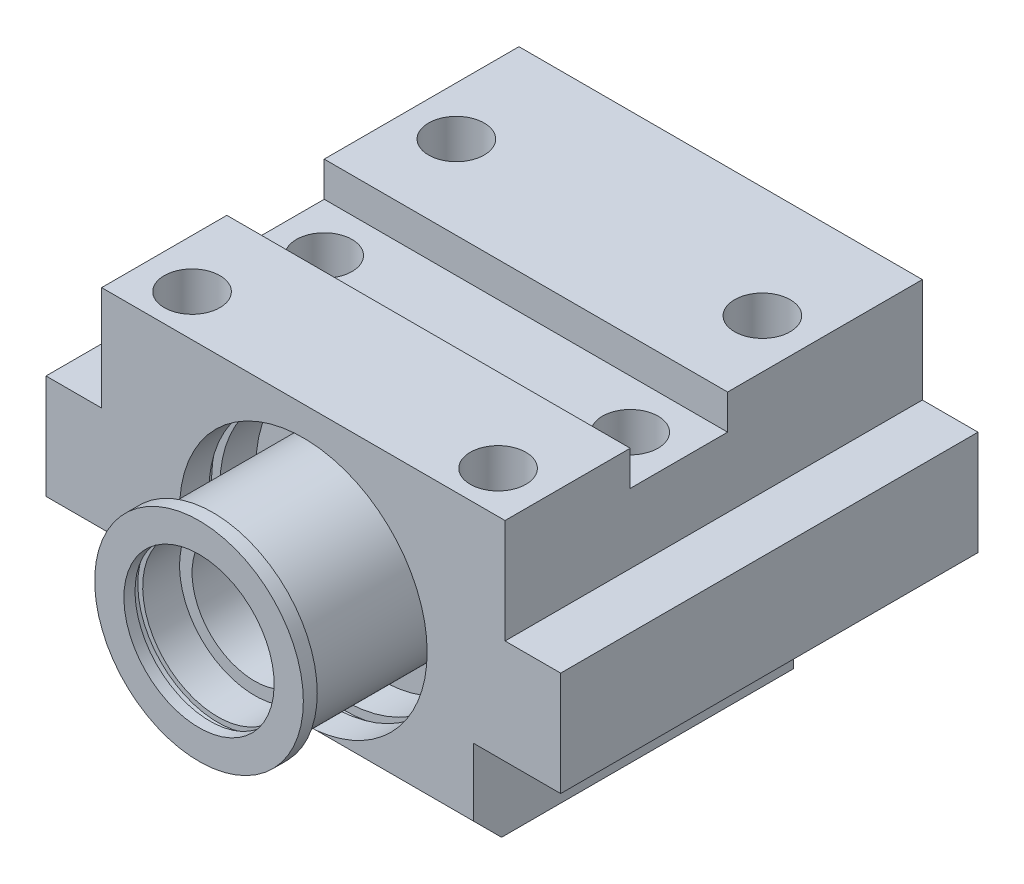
ISO-10303-21;
HEADER;
FILE_DESCRIPTION(('STEP AP214'),'2;1');
FILE_NAME('part.step','',(''),(''),'','','');
FILE_SCHEMA(('AUTOMOTIVE_DESIGN { 1 0 10303 214 1 1 1 1 }'));
ENDSEC;
DATA;
#1=APPLICATION_CONTEXT('core data for automotive mechanical design processes');
#2=APPLICATION_PROTOCOL_DEFINITION('international standard','automotive_design',2000,#1);
#3=PRODUCT_CONTEXT('',#1,'mechanical');
#4=PRODUCT('Part','Part','',(#3));
#5=PRODUCT_RELATED_PRODUCT_CATEGORY('part','',(#4));
#6=PRODUCT_DEFINITION_FORMATION('','',#4);
#7=PRODUCT_DEFINITION_CONTEXT('part definition',#1,'design');
#8=PRODUCT_DEFINITION('design','',#6,#7);
#9=PRODUCT_DEFINITION_SHAPE('','',#8);
#10=(LENGTH_UNIT() NAMED_UNIT(*) SI_UNIT(.MILLI.,.METRE.));
#11=(NAMED_UNIT(*) PLANE_ANGLE_UNIT() SI_UNIT($,.RADIAN.));
#12=(NAMED_UNIT(*) SI_UNIT($,.STERADIAN.) SOLID_ANGLE_UNIT());
#13=UNCERTAINTY_MEASURE_WITH_UNIT(LENGTH_MEASURE(1.E-05),#10,'distance_accuracy_value','');
#14=(GEOMETRIC_REPRESENTATION_CONTEXT(3) GLOBAL_UNCERTAINTY_ASSIGNED_CONTEXT((#13)) GLOBAL_UNIT_ASSIGNED_CONTEXT((#10,
#11,#12)) REPRESENTATION_CONTEXT('',''));
#15=CARTESIAN_POINT('',(0.,0.,0.));
#16=DIRECTION('',(0.,0.,1.));
#17=DIRECTION('',(1.,0.,0.));
#18=AXIS2_PLACEMENT_3D('',#15,#16,#17);
#19=CARTESIAN_POINT('',(29.,-43.7,-30.));
#20=DIRECTION('',(0.,0.,1.));
#21=DIRECTION('',(1.,0.,0.));
#22=AXIS2_PLACEMENT_3D('',#19,#20,#21);
#23=PLANE('',#22);
#24=CARTESIAN_POINT('',(-28.,-22.5,-30.));
#25=DIRECTION('',(0.,0.,-1.));
#26=DIRECTION('',(-1.,0.,0.));
#27=AXIS2_PLACEMENT_3D('',#24,#25,#26);
#28=CIRCLE('',#27,5.);
#29=CARTESIAN_POINT('',(-33.,-22.5,-30.));
#30=VERTEX_POINT('',#29);
#31=EDGE_CURVE('E1333',#30,#30,#28,.T.);
#32=ORIENTED_EDGE('',*,*,#31,.F.);
#33=EDGE_LOOP('',(#32));
#34=FACE_BOUND('',#33,.T.);
#35=CARTESIAN_POINT('',(0.,-22.,-30.));
#36=DIRECTION('',(0.,0.,1.));
#37=DIRECTION('',(1.,0.,0.));
#38=AXIS2_PLACEMENT_3D('',#35,#36,#37);
#39=CIRCLE('',#38,17.8);
#40=CARTESIAN_POINT('',(17.8,-22.,-30.));
#41=VERTEX_POINT('',#40);
#42=EDGE_CURVE('E241',#41,#41,#39,.T.);
#43=ORIENTED_EDGE('',*,*,#42,.T.);
#44=EDGE_LOOP('',(#43));
#45=FACE_BOUND('',#44,.T.);
#46=DIRECTION('',(0.,-1.,0.));
#47=VECTOR('',#46,1.);
#48=CARTESIAN_POINT('',(24.5,-30.,-30.));
#49=LINE('',#48,#47);
#50=CARTESIAN_POINT('',(24.5,-30.,-30.));
#51=VERTEX_POINT('',#50);
#52=CARTESIAN_POINT('',(24.5,-42.,-30.));
#53=VERTEX_POINT('',#52);
#54=EDGE_CURVE('E376',#51,#53,#49,.T.);
#55=ORIENTED_EDGE('',*,*,#54,.T.);
#56=DIRECTION('',(1.,0.,0.));
#57=VECTOR('',#56,1.);
#58=CARTESIAN_POINT('',(-37.,-42.,-30.));
#59=LINE('',#58,#57);
#60=CARTESIAN_POINT('',(-24.5,-42.,-30.));
#61=VERTEX_POINT('',#60);
#62=EDGE_CURVE('E359',#61,#53,#59,.T.);
#63=ORIENTED_EDGE('',*,*,#62,.F.);
#64=DIRECTION('',(0.,1.,0.));
#65=VECTOR('',#64,1.);
#66=CARTESIAN_POINT('',(-24.5,-43.7,-30.));
#67=LINE('',#66,#65);
#68=CARTESIAN_POINT('',(-24.5,-30.,-30.));
#69=VERTEX_POINT('',#68);
#70=EDGE_CURVE('E391',#61,#69,#67,.T.);
#71=ORIENTED_EDGE('',*,*,#70,.T.);
#72=DIRECTION('',(-1.,0.,0.));
#73=VECTOR('',#72,1.);
#74=CARTESIAN_POINT('',(-24.5,-30.,-30.));
#75=LINE('',#74,#73);
#76=CARTESIAN_POINT('',(-37.,-30.,-30.));
#77=VERTEX_POINT('',#76);
#78=EDGE_CURVE('E393',#69,#77,#75,.T.);
#79=ORIENTED_EDGE('',*,*,#78,.T.);
#80=DIRECTION('',(0.,-1.,0.));
#81=VECTOR('',#80,1.);
#82=CARTESIAN_POINT('',(-37.,-43.7,-30.));
#83=LINE('',#82,#81);
#84=CARTESIAN_POINT('',(-37.,-15.,-30.));
#85=VERTEX_POINT('',#84);
#86=EDGE_CURVE('E446',#85,#77,#83,.T.);
#87=ORIENTED_EDGE('',*,*,#86,.F.);
#88=DIRECTION('',(1.,0.,0.));
#89=VECTOR('',#88,1.);
#90=CARTESIAN_POINT('',(-37.,-15.,-30.));
#91=LINE('',#90,#89);
#92=CARTESIAN_POINT('',(-29.,-15.,-30.));
#93=VERTEX_POINT('',#92);
#94=EDGE_CURVE('E449',#85,#93,#91,.T.);
#95=ORIENTED_EDGE('',*,*,#94,.T.);
#96=DIRECTION('',(0.,1.,0.));
#97=VECTOR('',#96,1.);
#98=CARTESIAN_POINT('',(-29.,-43.7,-30.));
#99=LINE('',#98,#97);
#100=CARTESIAN_POINT('',(-29.,1.10154940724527E-13,-30.));
#101=VERTEX_POINT('',#100);
#102=EDGE_CURVE('E464',#93,#101,#99,.T.);
#103=ORIENTED_EDGE('',*,*,#102,.T.);
#104=DIRECTION('',(-1.,0.,0.));
#105=VECTOR('',#104,1.);
#106=CARTESIAN_POINT('',(-29.,1.10154940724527E-13,-30.));
#107=LINE('',#106,#105);
#108=CARTESIAN_POINT('',(29.,0.,-30.));
#109=VERTEX_POINT('',#108);
#110=EDGE_CURVE('E412',#109,#101,#107,.T.);
#111=ORIENTED_EDGE('',*,*,#110,.F.);
#112=DIRECTION('',(0.,1.,0.));
#113=VECTOR('',#112,1.);
#114=CARTESIAN_POINT('',(29.,-43.7,-30.));
#115=LINE('',#114,#113);
#116=CARTESIAN_POINT('',(29.,-15.,-30.));
#117=VERTEX_POINT('',#116);
#118=EDGE_CURVE('E462',#117,#109,#115,.T.);
#119=ORIENTED_EDGE('',*,*,#118,.F.);
#120=DIRECTION('',(-1.,0.,0.));
#121=VECTOR('',#120,1.);
#122=CARTESIAN_POINT('',(37.,-15.,-30.));
#123=LINE('',#122,#121);
#124=CARTESIAN_POINT('',(37.,-15.,-30.));
#125=VERTEX_POINT('',#124);
#126=EDGE_CURVE('E438',#125,#117,#123,.T.);
#127=ORIENTED_EDGE('',*,*,#126,.F.);
#128=DIRECTION('',(0.,1.,0.));
#129=VECTOR('',#128,1.);
#130=CARTESIAN_POINT('',(37.,-15.,-30.));
#131=LINE('',#130,#129);
#132=CARTESIAN_POINT('',(37.,-30.,-30.));
#133=VERTEX_POINT('',#132);
#134=EDGE_CURVE('E426',#133,#125,#131,.T.);
#135=ORIENTED_EDGE('',*,*,#134,.F.);
#136=DIRECTION('',(-1.,0.,0.));
#137=VECTOR('',#136,1.);
#138=CARTESIAN_POINT('',(37.,-30.,-30.));
#139=LINE('',#138,#137);
#140=EDGE_CURVE('E373',#133,#51,#139,.T.);
#141=ORIENTED_EDGE('',*,*,#140,.T.);
#142=EDGE_LOOP('',(#55,#63,#71,#79,#87,#95,#103,#111,#119,#127,#135,#141));
#143=FACE_BOUND('',#142,.T.);
#144=CARTESIAN_POINT('',(28.,-22.5,-30.));
#145=DIRECTION('',(0.,0.,-1.));
#146=DIRECTION('',(-1.,0.,0.));
#147=AXIS2_PLACEMENT_3D('',#144,#145,#146);
#148=CIRCLE('',#147,5.);
#149=CARTESIAN_POINT('',(23.,-22.5,-30.));
#150=VERTEX_POINT('',#149);
#151=EDGE_CURVE('E1327',#150,#150,#148,.T.);
#152=ORIENTED_EDGE('',*,*,#151,.F.);
#153=EDGE_LOOP('',(#152));
#154=FACE_BOUND('',#153,.T.);
#155=ADVANCED_FACE('F17',(#34,#45,#143,#154),#23,.F.);
#156=CARTESIAN_POINT('',(0.,-4.99999999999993,0.));
#157=DIRECTION('',(0.,1.,0.));
#158=DIRECTION('',(-1.,0.,0.));
#159=AXIS2_PLACEMENT_3D('',#156,#157,#158);
#160=PLANE('',#159);
#161=CARTESIAN_POINT('',(22.,-5.,5.00000000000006));
#162=DIRECTION('',(0.,1.,0.));
#163=DIRECTION('',(-1.,0.,0.));
#164=AXIS2_PLACEMENT_3D('',#161,#162,#163);
#165=CIRCLE('',#164,4.);
#166=CARTESIAN_POINT('',(18.,-4.99999999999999,5.00000000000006));
#167=VERTEX_POINT('',#166);
#168=EDGE_CURVE('E1295',#167,#167,#165,.T.);
#169=ORIENTED_EDGE('',*,*,#168,.F.);
#170=EDGE_LOOP('',(#169));
#171=FACE_BOUND('',#170,.T.);
#172=CARTESIAN_POINT('',(-22.,-4.9999999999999,5.00000000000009));
#173=DIRECTION('',(0.,1.,0.));
#174=DIRECTION('',(-1.,0.,0.));
#175=AXIS2_PLACEMENT_3D('',#172,#173,#174);
#176=CIRCLE('',#175,4.);
#177=CARTESIAN_POINT('',(-26.,-4.9999999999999,5.00000000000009));
#178=VERTEX_POINT('',#177);
#179=EDGE_CURVE('E1301',#178,#178,#176,.T.);
#180=ORIENTED_EDGE('',*,*,#179,.F.);
#181=EDGE_LOOP('',(#180));
#182=FACE_BOUND('',#181,.T.);
#183=DIRECTION('',(0.,0.,1.));
#184=VECTOR('',#183,1.);
#185=CARTESIAN_POINT('',(29.,-5.,30.));
#186=LINE('',#185,#184);
#187=CARTESIAN_POINT('',(29.,-5.,-2.));
#188=VERTEX_POINT('',#187);
#189=CARTESIAN_POINT('',(29.,-5.,12.));
#190=VERTEX_POINT('',#189);
#191=EDGE_CURVE('E460',#188,#190,#186,.T.);
#192=ORIENTED_EDGE('',*,*,#191,.F.);
#193=DIRECTION('',(1.,0.,0.));
#194=VECTOR('',#193,1.);
#195=CARTESIAN_POINT('',(29.,-5.,-2.));
#196=LINE('',#195,#194);
#197=CARTESIAN_POINT('',(-29.,-4.9999999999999,-2.));
#198=VERTEX_POINT('',#197);
#199=EDGE_CURVE('E403',#198,#188,#196,.T.);
#200=ORIENTED_EDGE('',*,*,#199,.F.);
#201=DIRECTION('',(0.,0.,-1.));
#202=VECTOR('',#201,1.);
#203=CARTESIAN_POINT('',(-29.,-4.9999999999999,-30.));
#204=LINE('',#203,#202);
#205=CARTESIAN_POINT('',(-29.,-4.99999999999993,12.));
#206=VERTEX_POINT('',#205);
#207=EDGE_CURVE('E457',#206,#198,#204,.T.);
#208=ORIENTED_EDGE('',*,*,#207,.F.);
#209=DIRECTION('',(-1.,0.,0.));
#210=VECTOR('',#209,1.);
#211=CARTESIAN_POINT('',(29.,-4.99999999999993,12.));
#212=LINE('',#211,#210);
#213=EDGE_CURVE('E467',#190,#206,#212,.T.);
#214=ORIENTED_EDGE('',*,*,#213,.F.);
#215=EDGE_LOOP('',(#192,#200,#208,#214));
#216=FACE_BOUND('',#215,.T.);
#217=ADVANCED_FACE('F586',(#171,#182,#216),#160,.T.);
#218=CARTESIAN_POINT('',(29.,-4.99999999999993,30.));
#219=DIRECTION('',(1.,0.,0.));
#220=DIRECTION('',(0.,0.,-1.));
#221=AXIS2_PLACEMENT_3D('',#218,#219,#220);
#222=PLANE('',#221);
#223=DIRECTION('',(0.,0.,1.));
#224=VECTOR('',#223,1.);
#225=CARTESIAN_POINT('',(29.,-15.,30.));
#226=LINE('',#225,#224);
#227=CARTESIAN_POINT('',(29.,-15.,30.));
#228=VERTEX_POINT('',#227);
#229=EDGE_CURVE('E425',#117,#228,#226,.T.);
#230=ORIENTED_EDGE('',*,*,#229,.F.);
#231=ORIENTED_EDGE('',*,*,#118,.T.);
#232=DIRECTION('',(0.,0.,-1.));
#233=VECTOR('',#232,1.);
#234=CARTESIAN_POINT('',(29.,0.,-30.));
#235=LINE('',#234,#233);
#236=CARTESIAN_POINT('',(29.,0.,-2.));
#237=VERTEX_POINT('',#236);
#238=EDGE_CURVE('E409',#237,#109,#235,.T.);
#239=ORIENTED_EDGE('',*,*,#238,.F.);
#240=DIRECTION('',(0.,-1.,0.));
#241=VECTOR('',#240,1.);
#242=CARTESIAN_POINT('',(29.,0.,-2.));
#243=LINE('',#242,#241);
#244=EDGE_CURVE('E419',#237,#188,#243,.T.);
#245=ORIENTED_EDGE('',*,*,#244,.T.);
#246=ORIENTED_EDGE('',*,*,#191,.T.);
#247=DIRECTION('',(0.,1.,0.));
#248=VECTOR('',#247,1.);
#249=CARTESIAN_POINT('',(29.,-4.99999999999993,12.));
#250=LINE('',#249,#248);
#251=CARTESIAN_POINT('',(29.,0.,12.));
#252=VERTEX_POINT('',#251);
#253=EDGE_CURVE('E470',#190,#252,#250,.T.);
#254=ORIENTED_EDGE('',*,*,#253,.T.);
#255=DIRECTION('',(0.,0.,-1.));
#256=VECTOR('',#255,1.);
#257=CARTESIAN_POINT('',(29.,0.,30.));
#258=LINE('',#257,#256);
#259=CARTESIAN_POINT('',(29.,0.,30.));
#260=VERTEX_POINT('',#259);
#261=EDGE_CURVE('E466',#260,#252,#258,.T.);
#262=ORIENTED_EDGE('',*,*,#261,.F.);
#263=DIRECTION('',(0.,1.,0.));
#264=VECTOR('',#263,1.);
#265=CARTESIAN_POINT('',(29.,-4.99999999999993,30.));
#266=LINE('',#265,#264);
#267=EDGE_CURVE('E481',#228,#260,#266,.T.);
#268=ORIENTED_EDGE('',*,*,#267,.F.);
#269=EDGE_LOOP('',(#230,#231,#239,#245,#246,#254,#262,#268));
#270=FACE_BOUND('',#269,.T.);
#271=ADVANCED_FACE('F550',(#270),#222,.T.);
#272=CARTESIAN_POINT('',(-29.,-4.99999999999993,30.));
#273=DIRECTION('',(0.,0.,1.));
#274=DIRECTION('',(1.,0.,0.));
#275=AXIS2_PLACEMENT_3D('',#272,#273,#274);
#276=PLANE('',#275);
#277=DIRECTION('',(0.,1.,0.));
#278=VECTOR('',#277,1.);
#279=CARTESIAN_POINT('',(-24.5,-43.7,30.));
#280=LINE('',#279,#278);
#281=CARTESIAN_POINT('',(-24.5,-39.7,30.));
#282=VERTEX_POINT('',#281);
#283=CARTESIAN_POINT('',(-24.5,-30.,30.));
#284=VERTEX_POINT('',#283);
#285=EDGE_CURVE('E387',#282,#284,#280,.T.);
#286=ORIENTED_EDGE('',*,*,#285,.F.);
#287=DIRECTION('',(1.,0.,0.));
#288=VECTOR('',#287,1.);
#289=CARTESIAN_POINT('',(24.5,-39.7,30.));
#290=LINE('',#289,#288);
#291=CARTESIAN_POINT('',(-1.88414436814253,-39.7,30.));
#292=VERTEX_POINT('',#291);
#293=EDGE_CURVE('E503',#282,#292,#290,.T.);
#294=ORIENTED_EDGE('',*,*,#293,.T.);
#295=CARTESIAN_POINT('',(0.,-22.,30.));
#296=DIRECTION('',(0.,0.,1.));
#297=DIRECTION('',(1.,0.,0.));
#298=AXIS2_PLACEMENT_3D('',#295,#296,#297);
#299=CIRCLE('',#298,17.8);
#300=CARTESIAN_POINT('',(1.88414436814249,-39.7,30.));
#301=VERTEX_POINT('',#300);
#302=EDGE_CURVE('E343',#301,#292,#299,.T.);
#303=ORIENTED_EDGE('',*,*,#302,.F.);
#304=DIRECTION('',(1.,0.,0.));
#305=VECTOR('',#304,1.);
#306=CARTESIAN_POINT('',(24.5,-39.7,30.));
#307=LINE('',#306,#305);
#308=CARTESIAN_POINT('',(24.5,-39.7,30.));
#309=VERTEX_POINT('',#308);
#310=EDGE_CURVE('E33',#301,#309,#307,.T.);
#311=ORIENTED_EDGE('',*,*,#310,.T.);
#312=DIRECTION('',(0.,-1.,0.));
#313=VECTOR('',#312,1.);
#314=CARTESIAN_POINT('',(24.5,-30.,30.));
#315=LINE('',#314,#313);
#316=CARTESIAN_POINT('',(24.5,-30.,30.));
#317=VERTEX_POINT('',#316);
#318=EDGE_CURVE('E377',#317,#309,#315,.T.);
#319=ORIENTED_EDGE('',*,*,#318,.F.);
#320=DIRECTION('',(-1.,0.,0.));
#321=VECTOR('',#320,1.);
#322=CARTESIAN_POINT('',(37.,-30.,30.));
#323=LINE('',#322,#321);
#324=CARTESIAN_POINT('',(37.,-30.,30.));
#325=VERTEX_POINT('',#324);
#326=EDGE_CURVE('E372',#325,#317,#323,.T.);
#327=ORIENTED_EDGE('',*,*,#326,.F.);
#328=DIRECTION('',(0.,-1.,0.));
#329=VECTOR('',#328,1.);
#330=CARTESIAN_POINT('',(37.,-43.7,30.));
#331=LINE('',#330,#329);
#332=CARTESIAN_POINT('',(37.,-15.,30.));
#333=VERTEX_POINT('',#332);
#334=EDGE_CURVE('E430',#333,#325,#331,.T.);
#335=ORIENTED_EDGE('',*,*,#334,.F.);
#336=DIRECTION('',(-1.,0.,0.));
#337=VECTOR('',#336,1.);
#338=CARTESIAN_POINT('',(37.,-15.,30.));
#339=LINE('',#338,#337);
#340=EDGE_CURVE('E433',#333,#228,#339,.T.);
#341=ORIENTED_EDGE('',*,*,#340,.T.);
#342=ORIENTED_EDGE('',*,*,#267,.T.);
#343=DIRECTION('',(1.,0.,0.));
#344=VECTOR('',#343,1.);
#345=CARTESIAN_POINT('',(-29.,0.,30.));
#346=LINE('',#345,#344);
#347=CARTESIAN_POINT('',(-29.,0.,30.));
#348=VERTEX_POINT('',#347);
#349=EDGE_CURVE('E471',#348,#260,#346,.T.);
#350=ORIENTED_EDGE('',*,*,#349,.F.);
#351=DIRECTION('',(0.,1.,0.));
#352=VECTOR('',#351,1.);
#353=CARTESIAN_POINT('',(-29.,-4.99999999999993,30.));
#354=LINE('',#353,#352);
#355=CARTESIAN_POINT('',(-29.,-15.,30.));
#356=VERTEX_POINT('',#355);
#357=EDGE_CURVE('E485',#356,#348,#354,.T.);
#358=ORIENTED_EDGE('',*,*,#357,.F.);
#359=DIRECTION('',(1.,0.,0.));
#360=VECTOR('',#359,1.);
#361=CARTESIAN_POINT('',(-37.,-15.,30.));
#362=LINE('',#361,#360);
#363=CARTESIAN_POINT('',(-37.,-15.,30.));
#364=VERTEX_POINT('',#363);
#365=EDGE_CURVE('E454',#364,#356,#362,.T.);
#366=ORIENTED_EDGE('',*,*,#365,.F.);
#367=DIRECTION('',(0.,1.,0.));
#368=VECTOR('',#367,1.);
#369=CARTESIAN_POINT('',(-37.,-15.,30.));
#370=LINE('',#369,#368);
#371=CARTESIAN_POINT('',(-37.,-30.,30.));
#372=VERTEX_POINT('',#371);
#373=EDGE_CURVE('E442',#372,#364,#370,.T.);
#374=ORIENTED_EDGE('',*,*,#373,.F.);
#375=DIRECTION('',(-1.,0.,0.));
#376=VECTOR('',#375,1.);
#377=CARTESIAN_POINT('',(-24.5,-30.,30.));
#378=LINE('',#377,#376);
#379=EDGE_CURVE('E394',#284,#372,#378,.T.);
#380=ORIENTED_EDGE('',*,*,#379,.F.);
#381=EDGE_LOOP('',(#286,#294,#303,#311,#319,#327,#335,#341,#342,#350,#358,#366,#374,#380));
#382=FACE_BOUND('',#381,.T.);
#383=ADVANCED_FACE('F506',(#382),#276,.T.);
#384=CARTESIAN_POINT('',(-29.,-4.99999999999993,12.));
#385=DIRECTION('',(-1.,0.,0.));
#386=DIRECTION('',(0.,0.,1.));
#387=AXIS2_PLACEMENT_3D('',#384,#385,#386);
#388=PLANE('',#387);
#389=DIRECTION('',(0.,0.,-1.));
#390=VECTOR('',#389,1.);
#391=CARTESIAN_POINT('',(-29.,-15.,-30.));
#392=LINE('',#391,#390);
#393=EDGE_CURVE('E441',#356,#93,#392,.T.);
#394=ORIENTED_EDGE('',*,*,#393,.F.);
#395=ORIENTED_EDGE('',*,*,#357,.T.);
#396=DIRECTION('',(0.,0.,1.));
#397=VECTOR('',#396,1.);
#398=CARTESIAN_POINT('',(-29.,0.,12.));
#399=LINE('',#398,#397);
#400=CARTESIAN_POINT('',(-29.,0.,12.));
#401=VERTEX_POINT('',#400);
#402=EDGE_CURVE('E477',#401,#348,#399,.T.);
#403=ORIENTED_EDGE('',*,*,#402,.F.);
#404=DIRECTION('',(0.,1.,0.));
#405=VECTOR('',#404,1.);
#406=CARTESIAN_POINT('',(-29.,-4.99999999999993,12.));
#407=LINE('',#406,#405);
#408=EDGE_CURVE('E487',#206,#401,#407,.T.);
#409=ORIENTED_EDGE('',*,*,#408,.F.);
#410=ORIENTED_EDGE('',*,*,#207,.T.);
#411=DIRECTION('',(0.,-1.,0.));
#412=VECTOR('',#411,1.);
#413=CARTESIAN_POINT('',(-29.,1.10154940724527E-13,-2.));
#414=LINE('',#413,#412);
#415=CARTESIAN_POINT('',(-29.,1.10154940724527E-13,-2.));
#416=VERTEX_POINT('',#415);
#417=EDGE_CURVE('E423',#416,#198,#414,.T.);
#418=ORIENTED_EDGE('',*,*,#417,.F.);
#419=DIRECTION('',(0.,0.,1.));
#420=VECTOR('',#419,1.);
#421=CARTESIAN_POINT('',(-29.,1.10154940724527E-13,-2.));
#422=LINE('',#421,#420);
#423=EDGE_CURVE('E415',#101,#416,#422,.T.);
#424=ORIENTED_EDGE('',*,*,#423,.F.);
#425=ORIENTED_EDGE('',*,*,#102,.F.);
#426=EDGE_LOOP('',(#394,#395,#403,#409,#410,#418,#424,#425));
#427=FACE_BOUND('',#426,.T.);
#428=ADVANCED_FACE('F558',(#427),#388,.T.);
#429=CARTESIAN_POINT('',(29.,-4.99999999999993,12.));
#430=DIRECTION('',(0.,0.,-1.));
#431=DIRECTION('',(-1.,0.,0.));
#432=AXIS2_PLACEMENT_3D('',#429,#430,#431);
#433=PLANE('',#432);
#434=DIRECTION('',(-1.,0.,0.));
#435=VECTOR('',#434,1.);
#436=CARTESIAN_POINT('',(29.,0.,12.));
#437=LINE('',#436,#435);
#438=EDGE_CURVE('E474',#252,#401,#437,.T.);
#439=ORIENTED_EDGE('',*,*,#438,.F.);
#440=ORIENTED_EDGE('',*,*,#253,.F.);
#441=ORIENTED_EDGE('',*,*,#213,.T.);
#442=ORIENTED_EDGE('',*,*,#408,.T.);
#443=EDGE_LOOP('',(#439,#440,#441,#442));
#444=FACE_BOUND('',#443,.T.);
#445=ADVANCED_FACE('F588',(#444),#433,.T.);
#446=CARTESIAN_POINT('',(0.,0.,0.));
#447=DIRECTION('',(0.,1.,0.));
#448=DIRECTION('',(0.,0.,1.));
#449=AXIS2_PLACEMENT_3D('',#446,#447,#448);
#450=PLANE('',#449);
#451=CARTESIAN_POINT('',(22.,0.,24.));
#452=DIRECTION('',(0.,1.,0.));
#453=DIRECTION('',(0.,0.,1.));
#454=AXIS2_PLACEMENT_3D('',#451,#452,#453);
#455=CIRCLE('',#454,4.);
#456=CARTESIAN_POINT('',(22.,0.,28.));
#457=VERTEX_POINT('',#456);
#458=EDGE_CURVE('E1311',#457,#457,#455,.T.);
#459=ORIENTED_EDGE('',*,*,#458,.F.);
#460=EDGE_LOOP('',(#459));
#461=FACE_BOUND('',#460,.T.);
#462=CARTESIAN_POINT('',(-22.,0.,24.));
#463=DIRECTION('',(0.,1.,0.));
#464=DIRECTION('',(0.,0.,1.));
#465=AXIS2_PLACEMENT_3D('',#462,#463,#464);
#466=CIRCLE('',#465,4.);
#467=CARTESIAN_POINT('',(-22.,0.,28.));
#468=VERTEX_POINT('',#467);
#469=EDGE_CURVE('E1304',#468,#468,#466,.T.);
#470=ORIENTED_EDGE('',*,*,#469,.F.);
#471=EDGE_LOOP('',(#470));
#472=FACE_BOUND('',#471,.T.);
#473=ORIENTED_EDGE('',*,*,#349,.T.);
#474=ORIENTED_EDGE('',*,*,#261,.T.);
#475=ORIENTED_EDGE('',*,*,#438,.T.);
#476=ORIENTED_EDGE('',*,*,#402,.T.);
#477=EDGE_LOOP('',(#473,#474,#475,#476));
#478=FACE_BOUND('',#477,.T.);
#479=ADVANCED_FACE('F554',(#461,#472,#478),#450,.T.);
#480=CARTESIAN_POINT('',(0.,-43.7,0.));
#481=DIRECTION('',(0.,1.,0.));
#482=DIRECTION('',(-1.,0.,0.));
#483=AXIS2_PLACEMENT_3D('',#480,#481,#482);
#484=PLANE('',#483);
#485=DIRECTION('',(0.,0.,1.));
#486=VECTOR('',#485,1.);
#487=CARTESIAN_POINT('',(24.5,-43.7,-30.));
#488=LINE('',#487,#486);
#489=CARTESIAN_POINT('',(24.5,-43.7,-16.));
#490=VERTEX_POINT('',#489);
#491=CARTESIAN_POINT('',(24.5,-43.7,26.));
#492=VERTEX_POINT('',#491);
#493=EDGE_CURVE('E384',#490,#492,#488,.T.);
#494=ORIENTED_EDGE('',*,*,#493,.T.);
#495=DIRECTION('',(-1.,0.,0.));
#496=VECTOR('',#495,1.);
#497=CARTESIAN_POINT('',(-24.5,-43.7,26.));
#498=LINE('',#497,#496);
#499=CARTESIAN_POINT('',(-24.5,-43.7,26.));
#500=VERTEX_POINT('',#499);
#501=EDGE_CURVE('E497',#492,#500,#498,.T.);
#502=ORIENTED_EDGE('',*,*,#501,.T.);
#503=DIRECTION('',(0.,0.,1.));
#504=VECTOR('',#503,1.);
#505=CARTESIAN_POINT('',(-24.5,-43.7,-30.));
#506=LINE('',#505,#504);
#507=CARTESIAN_POINT('',(-24.5,-43.7,-16.));
#508=VERTEX_POINT('',#507);
#509=EDGE_CURVE('E400',#508,#500,#506,.T.);
#510=ORIENTED_EDGE('',*,*,#509,.F.);
#511=DIRECTION('',(1.,0.,0.));
#512=VECTOR('',#511,1.);
#513=CARTESIAN_POINT('',(-37.,-43.7,-16.));
#514=LINE('',#513,#512);
#515=EDGE_CURVE('E360',#508,#490,#514,.T.);
#516=ORIENTED_EDGE('',*,*,#515,.T.);
#517=EDGE_LOOP('',(#494,#502,#510,#516));
#518=FACE_BOUND('',#517,.T.);
#519=ADVANCED_FACE('F517',(#518),#484,.F.);
#520=CARTESIAN_POINT('',(-37.,-15.,-30.));
#521=DIRECTION('',(0.,-1.,0.));
#522=DIRECTION('',(0.,0.,-1.));
#523=AXIS2_PLACEMENT_3D('',#520,#521,#522);
#524=PLANE('',#523);
#525=ORIENTED_EDGE('',*,*,#393,.T.);
#526=ORIENTED_EDGE('',*,*,#94,.F.);
#527=DIRECTION('',(0.,0.,-1.));
#528=VECTOR('',#527,1.);
#529=CARTESIAN_POINT('',(-37.,-15.,-30.));
#530=LINE('',#529,#528);
#531=EDGE_CURVE('E444',#364,#85,#530,.T.);
#532=ORIENTED_EDGE('',*,*,#531,.F.);
#533=ORIENTED_EDGE('',*,*,#365,.T.);
#534=EDGE_LOOP('',(#525,#526,#532,#533));
#535=FACE_BOUND('',#534,.T.);
#536=ADVANCED_FACE('F563',(#535),#524,.F.);
#537=CARTESIAN_POINT('',(-37.,0.,0.));
#538=DIRECTION('',(1.,0.,0.));
#539=DIRECTION('',(0.,0.,-1.));
#540=AXIS2_PLACEMENT_3D('',#537,#538,#539);
#541=PLANE('',#540);
#542=ORIENTED_EDGE('',*,*,#86,.T.);
#543=DIRECTION('',(0.,0.,1.));
#544=VECTOR('',#543,1.);
#545=CARTESIAN_POINT('',(-37.,-30.,-30.));
#546=LINE('',#545,#544);
#547=EDGE_CURVE('E404',#77,#372,#546,.T.);
#548=ORIENTED_EDGE('',*,*,#547,.T.);
#549=ORIENTED_EDGE('',*,*,#373,.T.);
#550=ORIENTED_EDGE('',*,*,#531,.T.);
#551=EDGE_LOOP('',(#542,#548,#549,#550));
#552=FACE_BOUND('',#551,.T.);
#553=ADVANCED_FACE('F567',(#552),#541,.F.);
#554=CARTESIAN_POINT('',(37.,-15.,30.));
#555=DIRECTION('',(0.,-1.,0.));
#556=DIRECTION('',(0.,0.,-1.));
#557=AXIS2_PLACEMENT_3D('',#554,#555,#556);
#558=PLANE('',#557);
#559=ORIENTED_EDGE('',*,*,#229,.T.);
#560=ORIENTED_EDGE('',*,*,#340,.F.);
#561=DIRECTION('',(0.,0.,1.));
#562=VECTOR('',#561,1.);
#563=CARTESIAN_POINT('',(37.,-15.,30.));
#564=LINE('',#563,#562);
#565=EDGE_CURVE('E428',#125,#333,#564,.T.);
#566=ORIENTED_EDGE('',*,*,#565,.F.);
#567=ORIENTED_EDGE('',*,*,#126,.T.);
#568=EDGE_LOOP('',(#559,#560,#566,#567));
#569=FACE_BOUND('',#568,.T.);
#570=ADVANCED_FACE('F545',(#569),#558,.F.);
#571=CARTESIAN_POINT('',(37.,0.,0.));
#572=DIRECTION('',(-1.,0.,0.));
#573=DIRECTION('',(0.,0.,1.));
#574=AXIS2_PLACEMENT_3D('',#571,#572,#573);
#575=PLANE('',#574);
#576=ORIENTED_EDGE('',*,*,#334,.T.);
#577=DIRECTION('',(0.,0.,1.));
#578=VECTOR('',#577,1.);
#579=CARTESIAN_POINT('',(37.,-30.,-30.));
#580=LINE('',#579,#578);
#581=EDGE_CURVE('E380',#133,#325,#580,.T.);
#582=ORIENTED_EDGE('',*,*,#581,.F.);
#583=ORIENTED_EDGE('',*,*,#134,.T.);
#584=ORIENTED_EDGE('',*,*,#565,.T.);
#585=EDGE_LOOP('',(#576,#582,#583,#584));
#586=FACE_BOUND('',#585,.T.);
#587=ADVANCED_FACE('F540',(#586),#575,.F.);
#588=CARTESIAN_POINT('',(29.,0.,-2.));
#589=DIRECTION('',(0.,0.,-1.));
#590=DIRECTION('',(0.,1.,0.));
#591=AXIS2_PLACEMENT_3D('',#588,#589,#590);
#592=PLANE('',#591);
#593=ORIENTED_EDGE('',*,*,#199,.T.);
#594=ORIENTED_EDGE('',*,*,#244,.F.);
#595=DIRECTION('',(1.,0.,0.));
#596=VECTOR('',#595,1.);
#597=CARTESIAN_POINT('',(29.,0.,-2.));
#598=LINE('',#597,#596);
#599=EDGE_CURVE('E417',#416,#237,#598,.T.);
#600=ORIENTED_EDGE('',*,*,#599,.F.);
#601=ORIENTED_EDGE('',*,*,#417,.T.);
#602=EDGE_LOOP('',(#593,#594,#600,#601));
#603=FACE_BOUND('',#602,.T.);
#604=ADVANCED_FACE('F582',(#603),#592,.F.);
#605=CARTESIAN_POINT('',(0.,0.,0.));
#606=DIRECTION('',(0.,-1.,0.));
#607=DIRECTION('',(1.,0.,0.));
#608=AXIS2_PLACEMENT_3D('',#605,#606,#607);
#609=PLANE('',#608);
#610=CARTESIAN_POINT('',(22.,0.,-14.));
#611=DIRECTION('',(0.,1.,0.));
#612=DIRECTION('',(0.,0.,1.));
#613=AXIS2_PLACEMENT_3D('',#610,#611,#612);
#614=CIRCLE('',#613,4.);
#615=CARTESIAN_POINT('',(22.,0.,-10.));
#616=VERTEX_POINT('',#615);
#617=EDGE_CURVE('E1315',#616,#616,#614,.T.);
#618=ORIENTED_EDGE('',*,*,#617,.F.);
#619=EDGE_LOOP('',(#618));
#620=FACE_BOUND('',#619,.T.);
#621=CARTESIAN_POINT('',(-22.,0.,-14.));
#622=DIRECTION('',(0.,1.,0.));
#623=DIRECTION('',(0.,0.,1.));
#624=AXIS2_PLACEMENT_3D('',#621,#622,#623);
#625=CIRCLE('',#624,4.);
#626=CARTESIAN_POINT('',(-22.,0.,-10.));
#627=VERTEX_POINT('',#626);
#628=EDGE_CURVE('E1321',#627,#627,#625,.T.);
#629=ORIENTED_EDGE('',*,*,#628,.F.);
#630=EDGE_LOOP('',(#629));
#631=FACE_BOUND('',#630,.T.);
#632=ORIENTED_EDGE('',*,*,#238,.T.);
#633=ORIENTED_EDGE('',*,*,#110,.T.);
#634=ORIENTED_EDGE('',*,*,#423,.T.);
#635=ORIENTED_EDGE('',*,*,#599,.T.);
#636=EDGE_LOOP('',(#632,#633,#634,#635));
#637=FACE_BOUND('',#636,.T.);
#638=ADVANCED_FACE('F575',(#620,#631,#637),#609,.F.);
#639=CARTESIAN_POINT('',(-24.5,-43.7,-30.));
#640=DIRECTION('',(1.,0.,0.));
#641=DIRECTION('',(0.,0.,-1.));
#642=AXIS2_PLACEMENT_3D('',#639,#640,#641);
#643=PLANE('',#642);
#644=ORIENTED_EDGE('',*,*,#509,.T.);
#645=DIRECTION('',(0.,0.707106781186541,0.707106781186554));
#646=VECTOR('',#645,1.);
#647=CARTESIAN_POINT('',(-24.5,-43.7,26.));
#648=LINE('',#647,#646);
#649=EDGE_CURVE('E500',#500,#282,#648,.T.);
#650=ORIENTED_EDGE('',*,*,#649,.T.);
#651=ORIENTED_EDGE('',*,*,#285,.T.);
#652=DIRECTION('',(0.,0.,1.));
#653=VECTOR('',#652,1.);
#654=CARTESIAN_POINT('',(-24.5,-30.,-30.));
#655=LINE('',#654,#653);
#656=EDGE_CURVE('E397',#69,#284,#655,.T.);
#657=ORIENTED_EDGE('',*,*,#656,.F.);
#658=ORIENTED_EDGE('',*,*,#70,.F.);
#659=DIRECTION('',(0.,0.,1.));
#660=VECTOR('',#659,1.);
#661=CARTESIAN_POINT('',(-24.5,-42.,-30.));
#662=LINE('',#661,#660);
#663=CARTESIAN_POINT('',(-24.5,-42.,-16.));
#664=VERTEX_POINT('',#663);
#665=EDGE_CURVE('E363',#61,#664,#662,.T.);
#666=ORIENTED_EDGE('',*,*,#665,.T.);
#667=DIRECTION('',(0.,-1.,0.));
#668=VECTOR('',#667,1.);
#669=CARTESIAN_POINT('',(-24.5,-43.7,-16.));
#670=LINE('',#669,#668);
#671=EDGE_CURVE('E369',#664,#508,#670,.T.);
#672=ORIENTED_EDGE('',*,*,#671,.T.);
#673=EDGE_LOOP('',(#644,#650,#651,#657,#658,#666,#672));
#674=FACE_BOUND('',#673,.T.);
#675=ADVANCED_FACE('F523',(#674),#643,.F.);
#676=CARTESIAN_POINT('',(-24.5,-30.,-30.));
#677=DIRECTION('',(0.,1.,0.));
#678=DIRECTION('',(0.,0.,1.));
#679=AXIS2_PLACEMENT_3D('',#676,#677,#678);
#680=PLANE('',#679);
#681=ORIENTED_EDGE('',*,*,#379,.T.);
#682=ORIENTED_EDGE('',*,*,#547,.F.);
#683=ORIENTED_EDGE('',*,*,#78,.F.);
#684=ORIENTED_EDGE('',*,*,#656,.T.);
#685=EDGE_LOOP('',(#681,#682,#683,#684));
#686=FACE_BOUND('',#685,.T.);
#687=ADVANCED_FACE('F569',(#686),#680,.F.);
#688=CARTESIAN_POINT('',(24.5,-30.,-30.));
#689=DIRECTION('',(-1.,0.,0.));
#690=DIRECTION('',(0.,0.,1.));
#691=AXIS2_PLACEMENT_3D('',#688,#689,#690);
#692=PLANE('',#691);
#693=ORIENTED_EDGE('',*,*,#318,.T.);
#694=DIRECTION('',(0.,-0.707106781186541,-0.707106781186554));
#695=VECTOR('',#694,1.);
#696=CARTESIAN_POINT('',(24.5,-43.7,26.));
#697=LINE('',#696,#695);
#698=EDGE_CURVE('E11',#309,#492,#697,.T.);
#699=ORIENTED_EDGE('',*,*,#698,.T.);
#700=ORIENTED_EDGE('',*,*,#493,.F.);
#701=DIRECTION('',(0.,-1.,0.));
#702=VECTOR('',#701,1.);
#703=CARTESIAN_POINT('',(24.5,-42.,-16.));
#704=LINE('',#703,#702);
#705=CARTESIAN_POINT('',(24.5,-42.,-16.));
#706=VERTEX_POINT('',#705);
#707=EDGE_CURVE('E357',#706,#490,#704,.T.);
#708=ORIENTED_EDGE('',*,*,#707,.F.);
#709=DIRECTION('',(0.,0.,1.));
#710=VECTOR('',#709,1.);
#711=CARTESIAN_POINT('',(24.5,-42.,-30.));
#712=LINE('',#711,#710);
#713=EDGE_CURVE('E354',#53,#706,#712,.T.);
#714=ORIENTED_EDGE('',*,*,#713,.F.);
#715=ORIENTED_EDGE('',*,*,#54,.F.);
#716=DIRECTION('',(0.,0.,1.));
#717=VECTOR('',#716,1.);
#718=CARTESIAN_POINT('',(24.5,-30.,-30.));
#719=LINE('',#718,#717);
#720=EDGE_CURVE('E388',#51,#317,#719,.T.);
#721=ORIENTED_EDGE('',*,*,#720,.T.);
#722=EDGE_LOOP('',(#693,#699,#700,#708,#714,#715,#721));
#723=FACE_BOUND('',#722,.T.);
#724=ADVANCED_FACE('F514',(#723),#692,.F.);
#725=CARTESIAN_POINT('',(37.,-30.,-30.));
#726=DIRECTION('',(0.,1.,0.));
#727=DIRECTION('',(0.,0.,1.));
#728=AXIS2_PLACEMENT_3D('',#725,#726,#727);
#729=PLANE('',#728);
#730=ORIENTED_EDGE('',*,*,#326,.T.);
#731=ORIENTED_EDGE('',*,*,#720,.F.);
#732=ORIENTED_EDGE('',*,*,#140,.F.);
#733=ORIENTED_EDGE('',*,*,#581,.T.);
#734=EDGE_LOOP('',(#730,#731,#732,#733));
#735=FACE_BOUND('',#734,.T.);
#736=ADVANCED_FACE('F536',(#735),#729,.F.);
#737=CARTESIAN_POINT('',(-37.,-42.,-16.));
#738=DIRECTION('',(0.,0.,1.));
#739=DIRECTION('',(1.,0.,0.));
#740=AXIS2_PLACEMENT_3D('',#737,#738,#739);
#741=PLANE('',#740);
#742=DIRECTION('',(1.,0.,0.));
#743=VECTOR('',#742,1.);
#744=CARTESIAN_POINT('',(-37.,-42.,-16.));
#745=LINE('',#744,#743);
#746=EDGE_CURVE('E364',#664,#706,#745,.T.);
#747=ORIENTED_EDGE('',*,*,#746,.T.);
#748=ORIENTED_EDGE('',*,*,#707,.T.);
#749=ORIENTED_EDGE('',*,*,#515,.F.);
#750=ORIENTED_EDGE('',*,*,#671,.F.);
#751=EDGE_LOOP('',(#747,#748,#749,#750));
#752=FACE_BOUND('',#751,.T.);
#753=ADVANCED_FACE('F520',(#752),#741,.F.);
#754=CARTESIAN_POINT('',(-37.,-42.,-30.));
#755=DIRECTION('',(0.,1.,0.));
#756=DIRECTION('',(0.,0.,1.));
#757=AXIS2_PLACEMENT_3D('',#754,#755,#756);
#758=PLANE('',#757);
#759=ORIENTED_EDGE('',*,*,#62,.T.);
#760=ORIENTED_EDGE('',*,*,#713,.T.);
#761=ORIENTED_EDGE('',*,*,#746,.F.);
#762=ORIENTED_EDGE('',*,*,#665,.F.);
#763=EDGE_LOOP('',(#759,#760,#761,#762));
#764=FACE_BOUND('',#763,.T.);
#765=ADVANCED_FACE('F528',(#764),#758,.F.);
#766=CARTESIAN_POINT('',(0.,-22.,-3.00000000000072));
#767=DIRECTION('',(0.,0.,1.));
#768=DIRECTION('',(1.,0.,0.));
#769=AXIS2_PLACEMENT_3D('',#766,#767,#768);
#770=PLANE('',#769);
#771=CARTESIAN_POINT('',(0.,-22.,-3.0000000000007));
#772=DIRECTION('',(0.,0.,-1.));
#773=DIRECTION('',(0.,1.,0.));
#774=AXIS2_PLACEMENT_3D('',#771,#772,#773);
#775=CIRCLE('',#774,13.5);
#776=CARTESIAN_POINT('',(0.,-8.5,-3.00000000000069));
#777=VERTEX_POINT('',#776);
#778=EDGE_CURVE('E311',#777,#777,#775,.T.);
#779=ORIENTED_EDGE('',*,*,#778,.F.);
#780=EDGE_LOOP('',(#779));
#781=FACE_BOUND('',#780,.T.);
#782=CARTESIAN_POINT('',(0.,-22.,-3.0000000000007));
#783=DIRECTION('',(0.,0.,-1.));
#784=DIRECTION('',(-1.,0.,0.));
#785=AXIS2_PLACEMENT_3D('',#782,#783,#784);
#786=CIRCLE('',#785,14.);
#787=CARTESIAN_POINT('',(-14.,-22.,-3.0000000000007));
#788=VERTEX_POINT('',#787);
#789=EDGE_CURVE('E351',#788,#788,#786,.T.);
#790=ORIENTED_EDGE('',*,*,#789,.T.);
#791=EDGE_LOOP('',(#790));
#792=FACE_BOUND('',#791,.T.);
#793=ADVANCED_FACE('F733',(#781,#792),#770,.F.);
#794=CARTESIAN_POINT('',(0.,-22.,-30.));
#795=DIRECTION('',(0.,0.,-1.));
#796=DIRECTION('',(-1.,0.,0.));
#797=AXIS2_PLACEMENT_3D('',#794,#795,#796);
#798=CYLINDRICAL_SURFACE('',#797,14.);
#799=CARTESIAN_POINT('',(0.,-22.,-22.));
#800=DIRECTION('',(0.,0.,1.));
#801=DIRECTION('',(1.,0.,0.));
#802=AXIS2_PLACEMENT_3D('',#799,#800,#801);
#803=CIRCLE('',#802,14.);
#804=CARTESIAN_POINT('',(14.,-22.,-22.));
#805=VERTEX_POINT('',#804);
#806=EDGE_CURVE('E260',#805,#805,#803,.T.);
#807=ORIENTED_EDGE('',*,*,#806,.F.);
#808=EDGE_LOOP('',(#807));
#809=FACE_BOUND('',#808,.T.);
#810=ORIENTED_EDGE('',*,*,#789,.F.);
#811=EDGE_LOOP('',(#810));
#812=FACE_BOUND('',#811,.T.);
#813=ADVANCED_FACE('F740',(#809,#812),#798,.F.);
#814=CARTESIAN_POINT('',(17.8,-22.,19.));
#815=DIRECTION('',(0.,0.,-1.));
#816=DIRECTION('',(-1.,0.,0.));
#817=AXIS2_PLACEMENT_3D('',#814,#815,#816);
#818=PLANE('',#817);
#819=CARTESIAN_POINT('',(0.,-22.,19.));
#820=DIRECTION('',(0.,0.,1.));
#821=DIRECTION('',(1.,0.,0.));
#822=AXIS2_PLACEMENT_3D('',#819,#820,#821);
#823=CIRCLE('',#822,14.);
#824=CARTESIAN_POINT('',(14.,-22.,19.));
#825=VERTEX_POINT('',#824);
#826=EDGE_CURVE('E345',#825,#825,#823,.T.);
#827=ORIENTED_EDGE('',*,*,#826,.F.);
#828=EDGE_LOOP('',(#827));
#829=FACE_BOUND('',#828,.T.);
#830=CARTESIAN_POINT('',(0.,-22.,19.));
#831=DIRECTION('',(0.,0.,1.));
#832=DIRECTION('',(1.,0.,0.));
#833=AXIS2_PLACEMENT_3D('',#830,#831,#832);
#834=CIRCLE('',#833,17.8);
#835=CARTESIAN_POINT('',(17.8,-22.,19.));
#836=VERTEX_POINT('',#835);
#837=EDGE_CURVE('E329',#836,#836,#834,.T.);
#838=ORIENTED_EDGE('',*,*,#837,.T.);
#839=EDGE_LOOP('',(#838));
#840=FACE_BOUND('',#839,.T.);
#841=ADVANCED_FACE('F748',(#829,#840),#818,.F.);
#842=CARTESIAN_POINT('',(0.,-22.,19.));
#843=DIRECTION('',(0.,0.,1.));
#844=DIRECTION('',(1.,0.,0.));
#845=AXIS2_PLACEMENT_3D('',#842,#843,#844);
#846=CYLINDRICAL_SURFACE('',#845,17.8);
#847=CARTESIAN_POINT('',(0.,-22.,25.8));
#848=DIRECTION('',(0.,0.,1.));
#849=DIRECTION('',(1.,0.,0.));
#850=AXIS2_PLACEMENT_3D('',#847,#848,#849);
#851=CIRCLE('',#850,17.8);
#852=CARTESIAN_POINT('',(17.8,-22.,25.8));
#853=VERTEX_POINT('',#852);
#854=EDGE_CURVE('E340',#853,#853,#851,.T.);
#855=ORIENTED_EDGE('',*,*,#854,.F.);
#856=EDGE_LOOP('',(#855));
#857=FACE_BOUND('',#856,.T.);
#858=ORIENTED_EDGE('',*,*,#302,.T.);
#859=CARTESIAN_POINT('',(0.,-22.,47.7));
#860=DIRECTION('',(0.,-0.707106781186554,0.707106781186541));
#861=DIRECTION('',(0.,0.707106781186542,0.707106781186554));
#862=AXIS2_PLACEMENT_3D('',#859,#860,#861);
#863=ELLIPSE('',#862,25.1730014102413,17.8);
#864=EDGE_CURVE('E26',#292,#301,#863,.T.);
#865=ORIENTED_EDGE('',*,*,#864,.T.);
#866=EDGE_LOOP('',(#858,#865));
#867=FACE_BOUND('',#866,.T.);
#868=ADVANCED_FACE('F509',(#857,#867),#846,.F.);
#869=CARTESIAN_POINT('',(17.8,-22.,25.8));
#870=DIRECTION('',(0.,0.,1.));
#871=DIRECTION('',(1.,0.,0.));
#872=AXIS2_PLACEMENT_3D('',#869,#870,#871);
#873=PLANE('',#872);
#874=CARTESIAN_POINT('',(0.,-22.,25.8));
#875=DIRECTION('',(0.,0.,1.));
#876=DIRECTION('',(1.,0.,0.));
#877=AXIS2_PLACEMENT_3D('',#874,#875,#876);
#878=CIRCLE('',#877,19.);
#879=CARTESIAN_POINT('',(19.,-22.,25.8));
#880=VERTEX_POINT('',#879);
#881=EDGE_CURVE('E337',#880,#880,#878,.T.);
#882=ORIENTED_EDGE('',*,*,#881,.F.);
#883=EDGE_LOOP('',(#882));
#884=FACE_BOUND('',#883,.T.);
#885=ORIENTED_EDGE('',*,*,#854,.T.);
#886=EDGE_LOOP('',(#885));
#887=FACE_BOUND('',#886,.T.);
#888=ADVANCED_FACE('F763',(#884,#887),#873,.F.);
#889=CARTESIAN_POINT('',(0.,-22.,19.));
#890=DIRECTION('',(0.,0.,1.));
#891=DIRECTION('',(1.,0.,0.));
#892=AXIS2_PLACEMENT_3D('',#889,#890,#891);
#893=CYLINDRICAL_SURFACE('',#892,19.);
#894=DIRECTION('',(0.,0.,1.));
#895=VECTOR('',#894,1.);
#896=CARTESIAN_POINT('',(-18.0277563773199,-16.,19.));
#897=LINE('',#896,#895);
#898=CARTESIAN_POINT('',(-18.0277563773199,-16.,24.2));
#899=VERTEX_POINT('',#898);
#900=CARTESIAN_POINT('',(-18.0277563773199,-16.,24.4704047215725));
#901=VERTEX_POINT('',#900);
#902=EDGE_CURVE('E191',#899,#901,#897,.T.);
#903=ORIENTED_EDGE('',*,*,#902,.T.);
#904=CARTESIAN_POINT('',(-18.0277563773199,-16.,24.4704047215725));
#905=CARTESIAN_POINT('',(-18.0251635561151,-15.992209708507,24.4485136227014));
#906=CARTESIAN_POINT('',(-18.0227315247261,-15.9849190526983,24.4264236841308));
#907=CARTESIAN_POINT('',(-18.0182148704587,-15.9714028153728,24.3819485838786));
#908=CARTESIAN_POINT('',(-18.0161293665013,-15.9651745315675,24.3595643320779));
#909=CARTESIAN_POINT('',(-18.0123179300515,-15.9538079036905,24.3144887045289));
#910=CARTESIAN_POINT('',(-18.0105920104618,-15.9486695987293,24.2917973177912));
#911=CARTESIAN_POINT('',(-18.0075120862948,-15.9395106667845,24.2461039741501));
#912=CARTESIAN_POINT('',(-18.0061590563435,-15.9354929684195,24.2231013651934));
#913=CARTESIAN_POINT('',(-18.0050031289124,-15.9320627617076,24.2));
#914=B_SPLINE_CURVE_WITH_KNOTS('',3,(#904,#905,#906,#907,#908,#909,#910,#911,#912,#913),
.UNSPECIFIED.,.F.,.F.,(4,2,2,2,4),(0.,0.0701364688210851,0.140091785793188,0.210049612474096,
0.280188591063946),.UNSPECIFIED.);
#915=CARTESIAN_POINT('',(-18.0050031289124,-15.9320627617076,24.2));
#916=VERTEX_POINT('',#915);
#917=EDGE_CURVE('E179',#901,#916,#914,.T.);
#918=ORIENTED_EDGE('',*,*,#917,.T.);
#919=CARTESIAN_POINT('',(0.,-22.,24.2));
#920=DIRECTION('',(0.,0.,1.));
#921=DIRECTION('',(1.,0.,0.));
#922=AXIS2_PLACEMENT_3D('',#919,#920,#921);
#923=CIRCLE('',#922,19.);
#924=CARTESIAN_POINT('',(18.0050031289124,-15.9320627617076,24.2));
#925=VERTEX_POINT('',#924);
#926=EDGE_CURVE('E335',#925,#916,#923,.T.);
#927=ORIENTED_EDGE('',*,*,#926,.F.);
#928=CARTESIAN_POINT('',(18.0050031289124,-15.9320627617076,24.2));
#929=CARTESIAN_POINT('',(18.0061590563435,-15.9354929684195,24.2231013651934));
#930=CARTESIAN_POINT('',(18.0075120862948,-15.9395106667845,24.2461039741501));
#931=CARTESIAN_POINT('',(18.0105920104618,-15.9486695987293,24.2917973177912));
#932=CARTESIAN_POINT('',(18.0123179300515,-15.9538079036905,24.3144887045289));
#933=CARTESIAN_POINT('',(18.0161293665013,-15.9651745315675,24.3595643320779));
#934=CARTESIAN_POINT('',(18.0182148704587,-15.9714028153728,24.3819485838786));
#935=CARTESIAN_POINT('',(18.0227315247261,-15.9849190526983,24.4264236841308));
#936=CARTESIAN_POINT('',(18.0251635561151,-15.992209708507,24.4485136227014));
#937=CARTESIAN_POINT('',(18.0277563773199,-16.,24.4704047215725));
#938=B_SPLINE_CURVE_WITH_KNOTS('',3,(#928,#929,#930,#931,#932,#933,#934,#935,#936,#937),
.UNSPECIFIED.,.F.,.F.,(4,2,2,2,4),(0.,0.0701389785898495,0.140096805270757,0.21005212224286,
0.280188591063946),.UNSPECIFIED.);
#939=CARTESIAN_POINT('',(18.0277563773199,-16.,24.4704047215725));
#940=VERTEX_POINT('',#939);
#941=EDGE_CURVE('E234',#925,#940,#938,.T.);
#942=ORIENTED_EDGE('',*,*,#941,.T.);
#943=DIRECTION('',(0.,0.,1.));
#944=VECTOR('',#943,1.);
#945=CARTESIAN_POINT('',(18.0277563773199,-16.,19.));
#946=LINE('',#945,#944);
#947=CARTESIAN_POINT('',(18.0277563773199,-16.,24.2));
#948=VERTEX_POINT('',#947);
#949=EDGE_CURVE('E242',#940,#948,#946,.F.);
#950=ORIENTED_EDGE('',*,*,#949,.T.);
#951=EDGE_CURVE('E203',#899,#948,#923,.T.);
#952=ORIENTED_EDGE('',*,*,#951,.F.);
#953=EDGE_LOOP('',(#903,#918,#927,#942,#950,#952));
#954=FACE_BOUND('',#953,.T.);
#955=ORIENTED_EDGE('',*,*,#881,.T.);
#956=EDGE_LOOP('',(#955));
#957=FACE_BOUND('',#956,.T.);
#958=ADVANCED_FACE('F200',(#954,#957),#893,.F.);
#959=CARTESIAN_POINT('',(19.,-22.,24.2));
#960=DIRECTION('',(0.,0.,-1.));
#961=DIRECTION('',(-1.,0.,0.));
#962=AXIS2_PLACEMENT_3D('',#959,#960,#961);
#963=PLANE('',#962);
#964=CARTESIAN_POINT('',(0.,-22.,24.2));
#965=DIRECTION('',(0.,0.,1.));
#966=DIRECTION('',(1.,0.,0.));
#967=AXIS2_PLACEMENT_3D('',#964,#965,#966);
#968=CIRCLE('',#967,17.8);
#969=CARTESIAN_POINT('',(17.8,-22.,24.2));
#970=VERTEX_POINT('',#969);
#971=EDGE_CURVE('E332',#970,#970,#968,.T.);
#972=ORIENTED_EDGE('',*,*,#971,.F.);
#973=EDGE_LOOP('',(#972));
#974=FACE_BOUND('',#973,.T.);
#975=ORIENTED_EDGE('',*,*,#926,.T.);
#976=DIRECTION('',(0.,1.,0.));
#977=VECTOR('',#976,1.);
#978=CARTESIAN_POINT('',(-18.0050031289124,-16.,24.2));
#979=LINE('',#978,#977);
#980=CARTESIAN_POINT('',(-18.0050031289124,-16.,24.2));
#981=VERTEX_POINT('',#980);
#982=EDGE_CURVE('E185',#916,#981,#979,.F.);
#983=ORIENTED_EDGE('',*,*,#982,.T.);
#984=DIRECTION('',(-1.,0.,0.));
#985=VECTOR('',#984,1.);
#986=CARTESIAN_POINT('',(19.,-16.,24.2));
#987=LINE('',#986,#985);
#988=EDGE_CURVE('E196',#981,#899,#987,.T.);
#989=ORIENTED_EDGE('',*,*,#988,.T.);
#990=ORIENTED_EDGE('',*,*,#951,.T.);
#991=DIRECTION('',(-1.,0.,0.));
#992=VECTOR('',#991,1.);
#993=CARTESIAN_POINT('',(19.,-16.,24.2));
#994=LINE('',#993,#992);
#995=CARTESIAN_POINT('',(18.0050031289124,-16.,24.2));
#996=VERTEX_POINT('',#995);
#997=EDGE_CURVE('E484',#948,#996,#994,.T.);
#998=ORIENTED_EDGE('',*,*,#997,.T.);
#999=DIRECTION('',(0.,1.,0.));
#1000=VECTOR('',#999,1.);
#1001=CARTESIAN_POINT('',(18.0050031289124,-16.,24.2));
#1002=LINE('',#1001,#1000);
#1003=EDGE_CURVE('E492',#996,#925,#1002,.T.);
#1004=ORIENTED_EDGE('',*,*,#1003,.T.);
#1005=EDGE_LOOP('',(#975,#983,#989,#990,#998,#1004));
#1006=FACE_BOUND('',#1005,.T.);
#1007=ADVANCED_FACE('F777',(#974,#1006),#963,.F.);
#1008=CARTESIAN_POINT('',(0.,-22.,19.));
#1009=DIRECTION('',(0.,0.,1.));
#1010=DIRECTION('',(1.,0.,0.));
#1011=AXIS2_PLACEMENT_3D('',#1008,#1009,#1010);
#1012=CYLINDRICAL_SURFACE('',#1011,17.8);
#1013=ORIENTED_EDGE('',*,*,#837,.F.);
#1014=EDGE_LOOP('',(#1013));
#1015=FACE_BOUND('',#1014,.T.);
#1016=ORIENTED_EDGE('',*,*,#971,.T.);
#1017=EDGE_LOOP('',(#1016));
#1018=FACE_BOUND('',#1017,.T.);
#1019=ADVANCED_FACE('F783',(#1015,#1018),#1012,.F.);
#1020=CARTESIAN_POINT('',(0.,-22.,16.9999999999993));
#1021=DIRECTION('',(0.,0.,-1.));
#1022=DIRECTION('',(-1.,0.,0.));
#1023=AXIS2_PLACEMENT_3D('',#1020,#1021,#1022);
#1024=PLANE('',#1023);
#1025=CARTESIAN_POINT('',(0.,-22.,16.9999999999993));
#1026=DIRECTION('',(0.,0.,1.));
#1027=DIRECTION('',(1.,0.,0.));
#1028=AXIS2_PLACEMENT_3D('',#1025,#1026,#1027);
#1029=CIRCLE('',#1028,13.5);
#1030=CARTESIAN_POINT('',(13.5,-22.,16.9999999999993));
#1031=VERTEX_POINT('',#1030);
#1032=EDGE_CURVE('E308',#1031,#1031,#1029,.T.);
#1033=ORIENTED_EDGE('',*,*,#1032,.F.);
#1034=EDGE_LOOP('',(#1033));
#1035=FACE_BOUND('',#1034,.T.);
#1036=CARTESIAN_POINT('',(0.,-22.,16.9999999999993));
#1037=DIRECTION('',(0.,0.,1.));
#1038=DIRECTION('',(1.,0.,0.));
#1039=AXIS2_PLACEMENT_3D('',#1036,#1037,#1038);
#1040=CIRCLE('',#1039,14.);
#1041=CARTESIAN_POINT('',(14.,-22.,16.9999999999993));
#1042=VERTEX_POINT('',#1041);
#1043=EDGE_CURVE('E348',#1042,#1042,#1040,.T.);
#1044=ORIENTED_EDGE('',*,*,#1043,.T.);
#1045=EDGE_LOOP('',(#1044));
#1046=FACE_BOUND('',#1045,.T.);
#1047=ADVANCED_FACE('F790',(#1035,#1046),#1024,.F.);
#1048=CARTESIAN_POINT('',(0.,-22.,30.));
#1049=DIRECTION('',(0.,0.,1.));
#1050=DIRECTION('',(1.,0.,0.));
#1051=AXIS2_PLACEMENT_3D('',#1048,#1049,#1050);
#1052=CYLINDRICAL_SURFACE('',#1051,14.);
#1053=ORIENTED_EDGE('',*,*,#826,.T.);
#1054=EDGE_LOOP('',(#1053));
#1055=FACE_BOUND('',#1054,.T.);
#1056=ORIENTED_EDGE('',*,*,#1043,.F.);
#1057=EDGE_LOOP('',(#1056));
#1058=FACE_BOUND('',#1057,.T.);
#1059=ADVANCED_FACE('F798',(#1055,#1058),#1052,.F.);
#1060=CARTESIAN_POINT('',(0.,-22.,-3.0000000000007));
#1061=DIRECTION('',(0.,0.,-1.));
#1062=DIRECTION('',(0.,1.,0.));
#1063=AXIS2_PLACEMENT_3D('',#1060,#1061,#1062);
#1064=CYLINDRICAL_SURFACE('',#1063,13.5);
#1065=ORIENTED_EDGE('',*,*,#778,.T.);
#1066=EDGE_LOOP('',(#1065));
#1067=FACE_BOUND('',#1066,.T.);
#1068=CARTESIAN_POINT('',(0.,-22.,-30.8000000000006));
#1069=DIRECTION('',(0.,0.,-1.));
#1070=DIRECTION('',(0.,1.,0.));
#1071=AXIS2_PLACEMENT_3D('',#1068,#1069,#1070);
#1072=CIRCLE('',#1071,13.5);
#1073=CARTESIAN_POINT('',(0.,-8.5,-30.8000000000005));
#1074=VERTEX_POINT('',#1073);
#1075=EDGE_CURVE('E326',#1074,#1074,#1072,.T.);
#1076=ORIENTED_EDGE('',*,*,#1075,.F.);
#1077=EDGE_LOOP('',(#1076));
#1078=FACE_BOUND('',#1077,.T.);
#1079=ADVANCED_FACE('F806',(#1067,#1078),#1064,.T.);
#1080=CARTESIAN_POINT('',(12.8,-22.,-30.8000000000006));
#1081=DIRECTION('',(0.,0.,-1.));
#1082=DIRECTION('',(0.,1.,0.));
#1083=AXIS2_PLACEMENT_3D('',#1080,#1081,#1082);
#1084=PLANE('',#1083);
#1085=ORIENTED_EDGE('',*,*,#1075,.T.);
#1086=EDGE_LOOP('',(#1085));
#1087=FACE_BOUND('',#1086,.T.);
#1088=CARTESIAN_POINT('',(0.,-22.,-30.8000000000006));
#1089=DIRECTION('',(0.,0.,-1.));
#1090=DIRECTION('',(0.,1.,0.));
#1091=AXIS2_PLACEMENT_3D('',#1088,#1089,#1090);
#1092=CIRCLE('',#1091,12.8);
#1093=CARTESIAN_POINT('',(0.,-9.2,-30.8000000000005));
#1094=VERTEX_POINT('',#1093);
#1095=EDGE_CURVE('E323',#1094,#1094,#1092,.T.);
#1096=ORIENTED_EDGE('',*,*,#1095,.F.);
#1097=EDGE_LOOP('',(#1096));
#1098=FACE_BOUND('',#1097,.T.);
#1099=ADVANCED_FACE('F814',(#1087,#1098),#1084,.T.);
#1100=CARTESIAN_POINT('',(0.,-22.,-3.0000000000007));
#1101=DIRECTION('',(0.,0.,-1.));
#1102=DIRECTION('',(0.,1.,0.));
#1103=AXIS2_PLACEMENT_3D('',#1100,#1101,#1102);
#1104=CYLINDRICAL_SURFACE('',#1103,12.8);
#1105=ORIENTED_EDGE('',*,*,#1095,.T.);
#1106=EDGE_LOOP('',(#1105));
#1107=FACE_BOUND('',#1106,.T.);
#1108=CARTESIAN_POINT('',(0.,-22.,-32.1000000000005));
#1109=DIRECTION('',(0.,0.,-1.));
#1110=DIRECTION('',(0.,1.,0.));
#1111=AXIS2_PLACEMENT_3D('',#1108,#1109,#1110);
#1112=CIRCLE('',#1111,12.8);
#1113=CARTESIAN_POINT('',(0.,-9.2,-32.1000000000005));
#1114=VERTEX_POINT('',#1113);
#1115=EDGE_CURVE('E320',#1114,#1114,#1112,.T.);
#1116=ORIENTED_EDGE('',*,*,#1115,.F.);
#1117=EDGE_LOOP('',(#1116));
#1118=FACE_BOUND('',#1117,.T.);
#1119=ADVANCED_FACE('F822',(#1107,#1118),#1104,.T.);
#1120=CARTESIAN_POINT('',(13.5,-22.,-32.1000000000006));
#1121=DIRECTION('',(0.,0.,1.));
#1122=DIRECTION('',(0.,-1.,0.));
#1123=AXIS2_PLACEMENT_3D('',#1120,#1121,#1122);
#1124=PLANE('',#1123);
#1125=ORIENTED_EDGE('',*,*,#1115,.T.);
#1126=EDGE_LOOP('',(#1125));
#1127=FACE_BOUND('',#1126,.T.);
#1128=CARTESIAN_POINT('',(0.,-22.,-32.1000000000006));
#1129=DIRECTION('',(0.,0.,-1.));
#1130=DIRECTION('',(0.,1.,0.));
#1131=AXIS2_PLACEMENT_3D('',#1128,#1129,#1130);
#1132=CIRCLE('',#1131,13.5);
#1133=CARTESIAN_POINT('',(0.,-8.5,-32.1000000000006));
#1134=VERTEX_POINT('',#1133);
#1135=EDGE_CURVE('E317',#1134,#1134,#1132,.T.);
#1136=ORIENTED_EDGE('',*,*,#1135,.F.);
#1137=EDGE_LOOP('',(#1136));
#1138=FACE_BOUND('',#1137,.T.);
#1139=ADVANCED_FACE('F830',(#1127,#1138),#1124,.T.);
#1140=CARTESIAN_POINT('',(0.,-22.,-3.0000000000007));
#1141=DIRECTION('',(0.,0.,-1.));
#1142=DIRECTION('',(0.,1.,0.));
#1143=AXIS2_PLACEMENT_3D('',#1140,#1141,#1142);
#1144=CYLINDRICAL_SURFACE('',#1143,13.5);
#1145=ORIENTED_EDGE('',*,*,#1135,.T.);
#1146=EDGE_LOOP('',(#1145));
#1147=FACE_BOUND('',#1146,.T.);
#1148=CARTESIAN_POINT('',(0.,-22.,-35.0000000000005));
#1149=DIRECTION('',(0.,0.,-1.));
#1150=DIRECTION('',(0.,1.,0.));
#1151=AXIS2_PLACEMENT_3D('',#1148,#1149,#1150);
#1152=CIRCLE('',#1151,13.5);
#1153=CARTESIAN_POINT('',(0.,-8.5,-35.0000000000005));
#1154=VERTEX_POINT('',#1153);
#1155=EDGE_CURVE('E314',#1154,#1154,#1152,.T.);
#1156=ORIENTED_EDGE('',*,*,#1155,.F.);
#1157=EDGE_LOOP('',(#1156));
#1158=FACE_BOUND('',#1157,.T.);
#1159=ADVANCED_FACE('F838',(#1147,#1158),#1144,.T.);
#1160=CARTESIAN_POINT('',(0.,-22.,-35.0000000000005));
#1161=DIRECTION('',(0.,0.,-1.));
#1162=DIRECTION('',(0.,1.,0.));
#1163=AXIS2_PLACEMENT_3D('',#1160,#1161,#1162);
#1164=PLANE('',#1163);
#1165=CARTESIAN_POINT('',(0.,-22.,-35.0000000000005));
#1166=DIRECTION('',(0.,0.,-1.));
#1167=DIRECTION('',(0.,1.,0.));
#1168=AXIS2_PLACEMENT_3D('',#1165,#1166,#1167);
#1169=CIRCLE('',#1168,10.8);
#1170=CARTESIAN_POINT('',(0.,-11.2,-35.0000000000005));
#1171=VERTEX_POINT('',#1170);
#1172=EDGE_CURVE('E293',#1171,#1171,#1169,.T.);
#1173=ORIENTED_EDGE('',*,*,#1172,.F.);
#1174=EDGE_LOOP('',(#1173));
#1175=FACE_BOUND('',#1174,.T.);
#1176=ORIENTED_EDGE('',*,*,#1155,.T.);
#1177=EDGE_LOOP('',(#1176));
#1178=FACE_BOUND('',#1177,.T.);
#1179=ADVANCED_FACE('F846',(#1175,#1178),#1164,.T.);
#1180=CARTESIAN_POINT('',(0.,-22.,16.9999999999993));
#1181=DIRECTION('',(0.,0.,1.));
#1182=DIRECTION('',(1.,0.,0.));
#1183=AXIS2_PLACEMENT_3D('',#1180,#1181,#1182);
#1184=CYLINDRICAL_SURFACE('',#1183,13.5);
#1185=ORIENTED_EDGE('',*,*,#1032,.T.);
#1186=EDGE_LOOP('',(#1185));
#1187=FACE_BOUND('',#1186,.T.);
#1188=CARTESIAN_POINT('',(0.,-22.,42.9999999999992));
#1189=DIRECTION('',(0.,0.,1.));
#1190=DIRECTION('',(1.,0.,0.));
#1191=AXIS2_PLACEMENT_3D('',#1188,#1189,#1190);
#1192=CIRCLE('',#1191,13.5);
#1193=CARTESIAN_POINT('',(13.5,-22.,42.9999999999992));
#1194=VERTEX_POINT('',#1193);
#1195=EDGE_CURVE('E299',#1194,#1194,#1192,.T.);
#1196=ORIENTED_EDGE('',*,*,#1195,.F.);
#1197=EDGE_LOOP('',(#1196));
#1198=FACE_BOUND('',#1197,.T.);
#1199=ADVANCED_FACE('F854',(#1187,#1198),#1184,.T.);
#1200=CARTESIAN_POINT('',(0.,-22.,44.9999999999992));
#1201=DIRECTION('',(0.,0.,1.));
#1202=DIRECTION('',(1.,0.,0.));
#1203=AXIS2_PLACEMENT_3D('',#1200,#1201,#1202);
#1204=PLANE('',#1203);
#1205=CARTESIAN_POINT('',(0.,-22.,44.9999999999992));
#1206=DIRECTION('',(0.,0.,-1.));
#1207=DIRECTION('',(0.,1.,0.));
#1208=AXIS2_PLACEMENT_3D('',#1205,#1206,#1207);
#1209=CIRCLE('',#1208,10.8);
#1210=CARTESIAN_POINT('',(0.,-11.2,44.9999999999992));
#1211=VERTEX_POINT('',#1210);
#1212=EDGE_CURVE('E296',#1211,#1211,#1209,.T.);
#1213=ORIENTED_EDGE('',*,*,#1212,.T.);
#1214=EDGE_LOOP('',(#1213));
#1215=FACE_BOUND('',#1214,.T.);
#1216=CARTESIAN_POINT('',(0.,-22.,44.9999999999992));
#1217=DIRECTION('',(0.,0.,1.));
#1218=DIRECTION('',(1.,0.,0.));
#1219=AXIS2_PLACEMENT_3D('',#1216,#1217,#1218);
#1220=CIRCLE('',#1219,15.);
#1221=CARTESIAN_POINT('',(15.,-22.,44.9999999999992));
#1222=VERTEX_POINT('',#1221);
#1223=EDGE_CURVE('E305',#1222,#1222,#1220,.T.);
#1224=ORIENTED_EDGE('',*,*,#1223,.T.);
#1225=EDGE_LOOP('',(#1224));
#1226=FACE_BOUND('',#1225,.T.);
#1227=ADVANCED_FACE('F862',(#1215,#1226),#1204,.T.);
#1228=CARTESIAN_POINT('',(0.,-22.,16.9999999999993));
#1229=DIRECTION('',(0.,0.,1.));
#1230=DIRECTION('',(1.,0.,0.));
#1231=AXIS2_PLACEMENT_3D('',#1228,#1229,#1230);
#1232=CYLINDRICAL_SURFACE('',#1231,15.);
#1233=CARTESIAN_POINT('',(0.,-22.,42.9999999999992));
#1234=DIRECTION('',(0.,0.,1.));
#1235=DIRECTION('',(1.,0.,0.));
#1236=AXIS2_PLACEMENT_3D('',#1233,#1234,#1235);
#1237=CIRCLE('',#1236,15.);
#1238=CARTESIAN_POINT('',(15.,-22.,42.9999999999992));
#1239=VERTEX_POINT('',#1238);
#1240=EDGE_CURVE('E302',#1239,#1239,#1237,.T.);
#1241=ORIENTED_EDGE('',*,*,#1240,.T.);
#1242=EDGE_LOOP('',(#1241));
#1243=FACE_BOUND('',#1242,.T.);
#1244=ORIENTED_EDGE('',*,*,#1223,.F.);
#1245=EDGE_LOOP('',(#1244));
#1246=FACE_BOUND('',#1245,.T.);
#1247=ADVANCED_FACE('F870',(#1243,#1246),#1232,.T.);
#1248=CARTESIAN_POINT('',(15.,-22.,42.9999999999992));
#1249=DIRECTION('',(0.,0.,-1.));
#1250=DIRECTION('',(-1.,0.,0.));
#1251=AXIS2_PLACEMENT_3D('',#1248,#1249,#1250);
#1252=PLANE('',#1251);
#1253=ORIENTED_EDGE('',*,*,#1195,.T.);
#1254=EDGE_LOOP('',(#1253));
#1255=FACE_BOUND('',#1254,.T.);
#1256=ORIENTED_EDGE('',*,*,#1240,.F.);
#1257=EDGE_LOOP('',(#1256));
#1258=FACE_BOUND('',#1257,.T.);
#1259=ADVANCED_FACE('F878',(#1255,#1258),#1252,.T.);
#1260=CARTESIAN_POINT('',(0.,-22.,44.9999999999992));
#1261=DIRECTION('',(0.,0.,-1.));
#1262=DIRECTION('',(0.,1.,0.));
#1263=AXIS2_PLACEMENT_3D('',#1260,#1261,#1262);
#1264=CYLINDRICAL_SURFACE('',#1263,10.8);
#1265=ORIENTED_EDGE('',*,*,#1212,.F.);
#1266=EDGE_LOOP('',(#1265));
#1267=FACE_BOUND('',#1266,.T.);
#1268=CARTESIAN_POINT('',(0.,-22.,43.3999999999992));
#1269=DIRECTION('',(0.,0.,-1.));
#1270=DIRECTION('',(0.,1.,0.));
#1271=AXIS2_PLACEMENT_3D('',#1268,#1269,#1270);
#1272=CIRCLE('',#1271,10.8);
#1273=CARTESIAN_POINT('',(0.,-11.2,43.3999999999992));
#1274=VERTEX_POINT('',#1273);
#1275=EDGE_CURVE('E263',#1274,#1274,#1272,.T.);
#1276=ORIENTED_EDGE('',*,*,#1275,.T.);
#1277=EDGE_LOOP('',(#1276));
#1278=FACE_BOUND('',#1277,.T.);
#1279=ADVANCED_FACE('F886',(#1267,#1278),#1264,.F.);
#1280=CARTESIAN_POINT('',(0.,-22.,44.9999999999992));
#1281=DIRECTION('',(0.,0.,-1.));
#1282=DIRECTION('',(0.,1.,0.));
#1283=AXIS2_PLACEMENT_3D('',#1280,#1281,#1282);
#1284=CYLINDRICAL_SURFACE('',#1283,10.8);
#1285=CARTESIAN_POINT('',(0.,-22.,-33.4000000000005));
#1286=DIRECTION('',(0.,0.,-1.));
#1287=DIRECTION('',(0.,1.,0.));
#1288=AXIS2_PLACEMENT_3D('',#1285,#1286,#1287);
#1289=CIRCLE('',#1288,10.8);
#1290=CARTESIAN_POINT('',(0.,-11.2,-33.4000000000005));
#1291=VERTEX_POINT('',#1290);
#1292=EDGE_CURVE('E290',#1291,#1291,#1289,.T.);
#1293=ORIENTED_EDGE('',*,*,#1292,.F.);
#1294=EDGE_LOOP('',(#1293));
#1295=FACE_BOUND('',#1294,.T.);
#1296=ORIENTED_EDGE('',*,*,#1172,.T.);
#1297=EDGE_LOOP('',(#1296));
#1298=FACE_BOUND('',#1297,.T.);
#1299=ADVANCED_FACE('F894',(#1295,#1298),#1284,.F.);
#1300=CARTESIAN_POINT('',(10.8,-22.,-33.4000000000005));
#1301=DIRECTION('',(0.,0.,-1.));
#1302=DIRECTION('',(0.,1.,0.));
#1303=AXIS2_PLACEMENT_3D('',#1300,#1301,#1302);
#1304=PLANE('',#1303);
#1305=CARTESIAN_POINT('',(0.,-22.,-33.4000000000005));
#1306=DIRECTION('',(0.,0.,-1.));
#1307=DIRECTION('',(0.,1.,0.));
#1308=AXIS2_PLACEMENT_3D('',#1305,#1306,#1307);
#1309=CIRCLE('',#1308,11.5);
#1310=CARTESIAN_POINT('',(0.,-10.5,-33.4000000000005));
#1311=VERTEX_POINT('',#1310);
#1312=EDGE_CURVE('E287',#1311,#1311,#1309,.T.);
#1313=ORIENTED_EDGE('',*,*,#1312,.F.);
#1314=EDGE_LOOP('',(#1313));
#1315=FACE_BOUND('',#1314,.T.);
#1316=ORIENTED_EDGE('',*,*,#1292,.T.);
#1317=EDGE_LOOP('',(#1316));
#1318=FACE_BOUND('',#1317,.T.);
#1319=ADVANCED_FACE('F902',(#1315,#1318),#1304,.F.);
#1320=CARTESIAN_POINT('',(0.,-22.,44.9999999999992));
#1321=DIRECTION('',(0.,0.,-1.));
#1322=DIRECTION('',(0.,1.,0.));
#1323=AXIS2_PLACEMENT_3D('',#1320,#1321,#1322);
#1324=CYLINDRICAL_SURFACE('',#1323,11.5);
#1325=CARTESIAN_POINT('',(0.,-22.,-32.3000000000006));
#1326=DIRECTION('',(0.,0.,-1.));
#1327=DIRECTION('',(0.,1.,0.));
#1328=AXIS2_PLACEMENT_3D('',#1325,#1326,#1327);
#1329=CIRCLE('',#1328,11.5);
#1330=CARTESIAN_POINT('',(0.,-10.5,-32.3000000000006));
#1331=VERTEX_POINT('',#1330);
#1332=EDGE_CURVE('E284',#1331,#1331,#1329,.T.);
#1333=ORIENTED_EDGE('',*,*,#1332,.F.);
#1334=EDGE_LOOP('',(#1333));
#1335=FACE_BOUND('',#1334,.T.);
#1336=ORIENTED_EDGE('',*,*,#1312,.T.);
#1337=EDGE_LOOP('',(#1336));
#1338=FACE_BOUND('',#1337,.T.);
#1339=ADVANCED_FACE('F910',(#1335,#1338),#1324,.F.);
#1340=CARTESIAN_POINT('',(11.5,-22.,-32.3000000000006));
#1341=DIRECTION('',(0.,0.,1.));
#1342=DIRECTION('',(0.,-1.,0.));
#1343=AXIS2_PLACEMENT_3D('',#1340,#1341,#1342);
#1344=PLANE('',#1343);
#1345=CARTESIAN_POINT('',(0.,-22.,-32.3000000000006));
#1346=DIRECTION('',(0.,0.,-1.));
#1347=DIRECTION('',(0.,1.,0.));
#1348=AXIS2_PLACEMENT_3D('',#1345,#1346,#1347);
#1349=CIRCLE('',#1348,10.8);
#1350=CARTESIAN_POINT('',(0.,-11.2,-32.3000000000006));
#1351=VERTEX_POINT('',#1350);
#1352=EDGE_CURVE('E281',#1351,#1351,#1349,.T.);
#1353=ORIENTED_EDGE('',*,*,#1352,.F.);
#1354=EDGE_LOOP('',(#1353));
#1355=FACE_BOUND('',#1354,.T.);
#1356=ORIENTED_EDGE('',*,*,#1332,.T.);
#1357=EDGE_LOOP('',(#1356));
#1358=FACE_BOUND('',#1357,.T.);
#1359=ADVANCED_FACE('F918',(#1355,#1358),#1344,.F.);
#1360=CARTESIAN_POINT('',(0.,-22.,44.9999999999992));
#1361=DIRECTION('',(0.,0.,-1.));
#1362=DIRECTION('',(0.,1.,0.));
#1363=AXIS2_PLACEMENT_3D('',#1360,#1361,#1362);
#1364=CYLINDRICAL_SURFACE('',#1363,10.8);
#1365=CARTESIAN_POINT('',(0.,-22.,-28.5000000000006));
#1366=DIRECTION('',(0.,0.,-1.));
#1367=DIRECTION('',(0.,1.,0.));
#1368=AXIS2_PLACEMENT_3D('',#1365,#1366,#1367);
#1369=CIRCLE('',#1368,10.8);
#1370=CARTESIAN_POINT('',(0.,-11.2,-28.5000000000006));
#1371=VERTEX_POINT('',#1370);
#1372=EDGE_CURVE('E278',#1371,#1371,#1369,.T.);
#1373=ORIENTED_EDGE('',*,*,#1372,.F.);
#1374=EDGE_LOOP('',(#1373));
#1375=FACE_BOUND('',#1374,.T.);
#1376=ORIENTED_EDGE('',*,*,#1352,.T.);
#1377=EDGE_LOOP('',(#1376));
#1378=FACE_BOUND('',#1377,.T.);
#1379=ADVANCED_FACE('F926',(#1375,#1378),#1364,.F.);
#1380=CARTESIAN_POINT('',(10.8,-22.,-28.5000000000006));
#1381=DIRECTION('',(0.,0.,1.));
#1382=DIRECTION('',(0.,-1.,0.));
#1383=AXIS2_PLACEMENT_3D('',#1380,#1381,#1382);
#1384=PLANE('',#1383);
#1385=CARTESIAN_POINT('',(0.,-22.,-28.5000000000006));
#1386=DIRECTION('',(0.,0.,1.));
#1387=DIRECTION('',(0.,-1.,0.));
#1388=AXIS2_PLACEMENT_3D('',#1385,#1386,#1387);
#1389=CIRCLE('',#1388,9.);
#1390=CARTESIAN_POINT('',(0.,-31.,-28.5000000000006));
#1391=VERTEX_POINT('',#1390);
#1392=EDGE_CURVE('E1298',#1391,#1391,#1389,.T.);
#1393=ORIENTED_EDGE('',*,*,#1392,.T.);
#1394=EDGE_LOOP('',(#1393));
#1395=FACE_BOUND('',#1394,.T.);
#1396=ORIENTED_EDGE('',*,*,#1372,.T.);
#1397=EDGE_LOOP('',(#1396));
#1398=FACE_BOUND('',#1397,.T.);
#1399=ADVANCED_FACE('F934',(#1395,#1398),#1384,.F.);
#1400=CARTESIAN_POINT('',(8.,-22.,36.9999999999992));
#1401=DIRECTION('',(0.,0.,-1.));
#1402=DIRECTION('',(0.,1.,0.));
#1403=AXIS2_PLACEMENT_3D('',#1400,#1401,#1402);
#1404=PLANE('',#1403);
#1405=CARTESIAN_POINT('',(0.,-22.,36.9999999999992));
#1406=DIRECTION('',(0.,0.,1.));
#1407=DIRECTION('',(1.,0.,0.));
#1408=AXIS2_PLACEMENT_3D('',#1405,#1406,#1407);
#1409=CIRCLE('',#1408,9.);
#1410=CARTESIAN_POINT('',(8.99999999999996,-22.,36.9999999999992));
#1411=VERTEX_POINT('',#1410);
#1412=EDGE_CURVE('E1294',#1411,#1411,#1409,.T.);
#1413=ORIENTED_EDGE('',*,*,#1412,.F.);
#1414=EDGE_LOOP('',(#1413));
#1415=FACE_BOUND('',#1414,.T.);
#1416=CARTESIAN_POINT('',(0.,-22.,36.9999999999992));
#1417=DIRECTION('',(0.,0.,-1.));
#1418=DIRECTION('',(0.,1.,0.));
#1419=AXIS2_PLACEMENT_3D('',#1416,#1417,#1418);
#1420=CIRCLE('',#1419,10.8);
#1421=CARTESIAN_POINT('',(0.,-11.2,36.9999999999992));
#1422=VERTEX_POINT('',#1421);
#1423=EDGE_CURVE('E275',#1422,#1422,#1420,.T.);
#1424=ORIENTED_EDGE('',*,*,#1423,.F.);
#1425=EDGE_LOOP('',(#1424));
#1426=FACE_BOUND('',#1425,.T.);
#1427=ADVANCED_FACE('F942',(#1415,#1426),#1404,.F.);
#1428=CARTESIAN_POINT('',(0.,-22.,44.9999999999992));
#1429=DIRECTION('',(0.,0.,-1.));
#1430=DIRECTION('',(0.,1.,0.));
#1431=AXIS2_PLACEMENT_3D('',#1428,#1429,#1430);
#1432=CYLINDRICAL_SURFACE('',#1431,10.8);
#1433=CARTESIAN_POINT('',(0.,-22.,42.2999999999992));
#1434=DIRECTION('',(0.,0.,-1.));
#1435=DIRECTION('',(0.,1.,0.));
#1436=AXIS2_PLACEMENT_3D('',#1433,#1434,#1435);
#1437=CIRCLE('',#1436,10.8);
#1438=CARTESIAN_POINT('',(0.,-11.2,42.2999999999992));
#1439=VERTEX_POINT('',#1438);
#1440=EDGE_CURVE('E272',#1439,#1439,#1437,.T.);
#1441=ORIENTED_EDGE('',*,*,#1440,.F.);
#1442=EDGE_LOOP('',(#1441));
#1443=FACE_BOUND('',#1442,.T.);
#1444=ORIENTED_EDGE('',*,*,#1423,.T.);
#1445=EDGE_LOOP('',(#1444));
#1446=FACE_BOUND('',#1445,.T.);
#1447=ADVANCED_FACE('F950',(#1443,#1446),#1432,.F.);
#1448=CARTESIAN_POINT('',(10.8,-22.,42.2999999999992));
#1449=DIRECTION('',(0.,0.,-1.));
#1450=DIRECTION('',(0.,1.,0.));
#1451=AXIS2_PLACEMENT_3D('',#1448,#1449,#1450);
#1452=PLANE('',#1451);
#1453=CARTESIAN_POINT('',(0.,-22.,42.2999999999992));
#1454=DIRECTION('',(0.,0.,-1.));
#1455=DIRECTION('',(0.,1.,0.));
#1456=AXIS2_PLACEMENT_3D('',#1453,#1454,#1455);
#1457=CIRCLE('',#1456,11.5);
#1458=CARTESIAN_POINT('',(0.,-10.5,42.2999999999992));
#1459=VERTEX_POINT('',#1458);
#1460=EDGE_CURVE('E269',#1459,#1459,#1457,.T.);
#1461=ORIENTED_EDGE('',*,*,#1460,.F.);
#1462=EDGE_LOOP('',(#1461));
#1463=FACE_BOUND('',#1462,.T.);
#1464=ORIENTED_EDGE('',*,*,#1440,.T.);
#1465=EDGE_LOOP('',(#1464));
#1466=FACE_BOUND('',#1465,.T.);
#1467=ADVANCED_FACE('F958',(#1463,#1466),#1452,.F.);
#1468=CARTESIAN_POINT('',(0.,-22.,44.9999999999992));
#1469=DIRECTION('',(0.,0.,-1.));
#1470=DIRECTION('',(0.,1.,0.));
#1471=AXIS2_PLACEMENT_3D('',#1468,#1469,#1470);
#1472=CYLINDRICAL_SURFACE('',#1471,11.5);
#1473=CARTESIAN_POINT('',(0.,-22.,43.3999999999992));
#1474=DIRECTION('',(0.,0.,-1.));
#1475=DIRECTION('',(0.,1.,0.));
#1476=AXIS2_PLACEMENT_3D('',#1473,#1474,#1475);
#1477=CIRCLE('',#1476,11.5);
#1478=CARTESIAN_POINT('',(0.,-10.5,43.3999999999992));
#1479=VERTEX_POINT('',#1478);
#1480=EDGE_CURVE('E266',#1479,#1479,#1477,.T.);
#1481=ORIENTED_EDGE('',*,*,#1480,.F.);
#1482=EDGE_LOOP('',(#1481));
#1483=FACE_BOUND('',#1482,.T.);
#1484=ORIENTED_EDGE('',*,*,#1460,.T.);
#1485=EDGE_LOOP('',(#1484));
#1486=FACE_BOUND('',#1485,.T.);
#1487=ADVANCED_FACE('F966',(#1483,#1486),#1472,.F.);
#1488=CARTESIAN_POINT('',(11.5,-22.,43.3999999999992));
#1489=DIRECTION('',(0.,0.,1.));
#1490=DIRECTION('',(0.,-1.,0.));
#1491=AXIS2_PLACEMENT_3D('',#1488,#1489,#1490);
#1492=PLANE('',#1491);
#1493=ORIENTED_EDGE('',*,*,#1275,.F.);
#1494=EDGE_LOOP('',(#1493));
#1495=FACE_BOUND('',#1494,.T.);
#1496=ORIENTED_EDGE('',*,*,#1480,.T.);
#1497=EDGE_LOOP('',(#1496));
#1498=FACE_BOUND('',#1497,.T.);
#1499=ADVANCED_FACE('F974',(#1495,#1498),#1492,.F.);
#1500=CARTESIAN_POINT('',(14.,-22.,-22.));
#1501=DIRECTION('',(0.,0.,1.));
#1502=DIRECTION('',(1.,0.,0.));
#1503=AXIS2_PLACEMENT_3D('',#1500,#1501,#1502);
#1504=PLANE('',#1503);
#1505=CARTESIAN_POINT('',(0.,-22.,-22.));
#1506=DIRECTION('',(0.,0.,1.));
#1507=DIRECTION('',(1.,0.,0.));
#1508=AXIS2_PLACEMENT_3D('',#1505,#1506,#1507);
#1509=CIRCLE('',#1508,17.8);
#1510=CARTESIAN_POINT('',(17.8,-22.,-22.));
#1511=VERTEX_POINT('',#1510);
#1512=EDGE_CURVE('E257',#1511,#1511,#1509,.T.);
#1513=ORIENTED_EDGE('',*,*,#1512,.F.);
#1514=EDGE_LOOP('',(#1513));
#1515=FACE_BOUND('',#1514,.T.);
#1516=ORIENTED_EDGE('',*,*,#806,.T.);
#1517=EDGE_LOOP('',(#1516));
#1518=FACE_BOUND('',#1517,.T.);
#1519=ADVANCED_FACE('F982',(#1515,#1518),#1504,.F.);
#1520=CARTESIAN_POINT('',(0.,-22.,-30.));
#1521=DIRECTION('',(0.,0.,1.));
#1522=DIRECTION('',(1.,0.,0.));
#1523=AXIS2_PLACEMENT_3D('',#1520,#1521,#1522);
#1524=CYLINDRICAL_SURFACE('',#1523,17.8);
#1525=CARTESIAN_POINT('',(0.,-22.,-27.3));
#1526=DIRECTION('',(0.,0.,1.));
#1527=DIRECTION('',(1.,0.,0.));
#1528=AXIS2_PLACEMENT_3D('',#1525,#1526,#1527);
#1529=CIRCLE('',#1528,17.8);
#1530=CARTESIAN_POINT('',(17.8,-22.,-27.3));
#1531=VERTEX_POINT('',#1530);
#1532=EDGE_CURVE('E254',#1531,#1531,#1529,.T.);
#1533=ORIENTED_EDGE('',*,*,#1532,.F.);
#1534=EDGE_LOOP('',(#1533));
#1535=FACE_BOUND('',#1534,.T.);
#1536=ORIENTED_EDGE('',*,*,#1512,.T.);
#1537=EDGE_LOOP('',(#1536));
#1538=FACE_BOUND('',#1537,.T.);
#1539=ADVANCED_FACE('F990',(#1535,#1538),#1524,.F.);
#1540=CARTESIAN_POINT('',(17.8,-22.,-27.3));
#1541=DIRECTION('',(0.,0.,1.));
#1542=DIRECTION('',(1.,0.,0.));
#1543=AXIS2_PLACEMENT_3D('',#1540,#1541,#1542);
#1544=PLANE('',#1543);
#1545=CARTESIAN_POINT('',(0.,-22.,-27.3));
#1546=DIRECTION('',(0.,0.,1.));
#1547=DIRECTION('',(1.,0.,0.));
#1548=AXIS2_PLACEMENT_3D('',#1545,#1546,#1547);
#1549=CIRCLE('',#1548,19.);
#1550=CARTESIAN_POINT('',(19.,-22.,-27.3));
#1551=VERTEX_POINT('',#1550);
#1552=EDGE_CURVE('E251',#1551,#1551,#1549,.T.);
#1553=ORIENTED_EDGE('',*,*,#1552,.F.);
#1554=EDGE_LOOP('',(#1553));
#1555=FACE_BOUND('',#1554,.T.);
#1556=ORIENTED_EDGE('',*,*,#1532,.T.);
#1557=EDGE_LOOP('',(#1556));
#1558=FACE_BOUND('',#1557,.T.);
#1559=ADVANCED_FACE('F998',(#1555,#1558),#1544,.F.);
#1560=CARTESIAN_POINT('',(0.,-22.,-30.));
#1561=DIRECTION('',(0.,0.,1.));
#1562=DIRECTION('',(1.,0.,0.));
#1563=AXIS2_PLACEMENT_3D('',#1560,#1561,#1562);
#1564=CYLINDRICAL_SURFACE('',#1563,19.);
#1565=CARTESIAN_POINT('',(0.,-22.,-28.9));
#1566=DIRECTION('',(0.,0.,1.));
#1567=DIRECTION('',(1.,0.,0.));
#1568=AXIS2_PLACEMENT_3D('',#1565,#1566,#1567);
#1569=CIRCLE('',#1568,19.);
#1570=CARTESIAN_POINT('',(19.,-22.,-28.9));
#1571=VERTEX_POINT('',#1570);
#1572=EDGE_CURVE('E248',#1571,#1571,#1569,.T.);
#1573=ORIENTED_EDGE('',*,*,#1572,.F.);
#1574=EDGE_LOOP('',(#1573));
#1575=FACE_BOUND('',#1574,.T.);
#1576=ORIENTED_EDGE('',*,*,#1552,.T.);
#1577=EDGE_LOOP('',(#1576));
#1578=FACE_BOUND('',#1577,.T.);
#1579=ADVANCED_FACE('F1006',(#1575,#1578),#1564,.F.);
#1580=CARTESIAN_POINT('',(19.,-22.,-28.9));
#1581=DIRECTION('',(0.,0.,-1.));
#1582=DIRECTION('',(-1.,0.,0.));
#1583=AXIS2_PLACEMENT_3D('',#1580,#1581,#1582);
#1584=PLANE('',#1583);
#1585=CARTESIAN_POINT('',(0.,-22.,-28.9));
#1586=DIRECTION('',(0.,0.,1.));
#1587=DIRECTION('',(1.,0.,0.));
#1588=AXIS2_PLACEMENT_3D('',#1585,#1586,#1587);
#1589=CIRCLE('',#1588,17.8);
#1590=CARTESIAN_POINT('',(17.8,-22.,-28.9));
#1591=VERTEX_POINT('',#1590);
#1592=EDGE_CURVE('E245',#1591,#1591,#1589,.T.);
#1593=ORIENTED_EDGE('',*,*,#1592,.F.);
#1594=EDGE_LOOP('',(#1593));
#1595=FACE_BOUND('',#1594,.T.);
#1596=ORIENTED_EDGE('',*,*,#1572,.T.);
#1597=EDGE_LOOP('',(#1596));
#1598=FACE_BOUND('',#1597,.T.);
#1599=ADVANCED_FACE('F1014',(#1595,#1598),#1584,.F.);
#1600=CARTESIAN_POINT('',(0.,-22.,-30.));
#1601=DIRECTION('',(0.,0.,1.));
#1602=DIRECTION('',(1.,0.,0.));
#1603=AXIS2_PLACEMENT_3D('',#1600,#1601,#1602);
#1604=CYLINDRICAL_SURFACE('',#1603,17.8);
#1605=ORIENTED_EDGE('',*,*,#42,.F.);
#1606=EDGE_LOOP('',(#1605));
#1607=FACE_BOUND('',#1606,.T.);
#1608=ORIENTED_EDGE('',*,*,#1592,.T.);
#1609=EDGE_LOOP('',(#1608));
#1610=FACE_BOUND('',#1609,.T.);
#1611=ADVANCED_FACE('F230',(#1607,#1610),#1604,.F.);
#1612=CARTESIAN_POINT('',(22.,-16.,24.));
#1613=DIRECTION('',(0.,1.,0.));
#1614=DIRECTION('',(0.,0.,1.));
#1615=AXIS2_PLACEMENT_3D('',#1612,#1613,#1614);
#1616=CYLINDRICAL_SURFACE('',#1615,4.);
#1617=ORIENTED_EDGE('',*,*,#1003,.F.);
#1618=CARTESIAN_POINT('',(22.,-16.,24.));
#1619=DIRECTION('',(0.,1.,0.));
#1620=DIRECTION('',(0.,0.,1.));
#1621=AXIS2_PLACEMENT_3D('',#1618,#1619,#1620);
#1622=CIRCLE('',#1621,4.);
#1623=EDGE_CURVE('E190',#940,#996,#1622,.T.);
#1624=ORIENTED_EDGE('',*,*,#1623,.F.);
#1625=ORIENTED_EDGE('',*,*,#941,.F.);
#1626=EDGE_LOOP('',(#1617,#1624,#1625));
#1627=FACE_BOUND('',#1626,.T.);
#1628=ORIENTED_EDGE('',*,*,#458,.T.);
#1629=EDGE_LOOP('',(#1628));
#1630=FACE_BOUND('',#1629,.T.);
#1631=ADVANCED_FACE('F225',(#1627,#1630),#1616,.F.);
#1632=CARTESIAN_POINT('',(18.,-16.,24.));
#1633=DIRECTION('',(0.,-1.,0.));
#1634=DIRECTION('',(0.,0.,-1.));
#1635=AXIS2_PLACEMENT_3D('',#1632,#1633,#1634);
#1636=PLANE('',#1635);
#1637=ORIENTED_EDGE('',*,*,#1623,.T.);
#1638=ORIENTED_EDGE('',*,*,#997,.F.);
#1639=ORIENTED_EDGE('',*,*,#949,.F.);
#1640=EDGE_LOOP('',(#1637,#1638,#1639));
#1641=FACE_BOUND('',#1640,.T.);
#1642=ADVANCED_FACE('F221',(#1641),#1636,.F.);
#1643=CARTESIAN_POINT('',(-22.,-16.,24.));
#1644=DIRECTION('',(0.,1.,0.));
#1645=DIRECTION('',(0.,0.,1.));
#1646=AXIS2_PLACEMENT_3D('',#1643,#1644,#1645);
#1647=CYLINDRICAL_SURFACE('',#1646,4.);
#1648=CARTESIAN_POINT('',(-22.,-16.,24.));
#1649=DIRECTION('',(0.,1.,0.));
#1650=DIRECTION('',(0.,0.,1.));
#1651=AXIS2_PLACEMENT_3D('',#1648,#1649,#1650);
#1652=CIRCLE('',#1651,4.);
#1653=EDGE_CURVE('E183',#981,#901,#1652,.T.);
#1654=ORIENTED_EDGE('',*,*,#1653,.F.);
#1655=ORIENTED_EDGE('',*,*,#982,.F.);
#1656=ORIENTED_EDGE('',*,*,#917,.F.);
#1657=EDGE_LOOP('',(#1654,#1655,#1656));
#1658=FACE_BOUND('',#1657,.T.);
#1659=ORIENTED_EDGE('',*,*,#469,.T.);
#1660=EDGE_LOOP('',(#1659));
#1661=FACE_BOUND('',#1660,.T.);
#1662=ADVANCED_FACE('F181',(#1658,#1661),#1647,.F.);
#1663=CARTESIAN_POINT('',(-26.,-16.,24.));
#1664=DIRECTION('',(0.,-1.,0.));
#1665=DIRECTION('',(0.,0.,-1.));
#1666=AXIS2_PLACEMENT_3D('',#1663,#1664,#1665);
#1667=PLANE('',#1666);
#1668=ORIENTED_EDGE('',*,*,#988,.F.);
#1669=ORIENTED_EDGE('',*,*,#1653,.T.);
#1670=ORIENTED_EDGE('',*,*,#902,.F.);
#1671=EDGE_LOOP('',(#1668,#1669,#1670));
#1672=FACE_BOUND('',#1671,.T.);
#1673=ADVANCED_FACE('F194',(#1672),#1667,.F.);
#1674=CARTESIAN_POINT('',(-28.,-22.5,-14.));
#1675=DIRECTION('',(0.,0.,1.));
#1676=DIRECTION('',(1.,0.,0.));
#1677=AXIS2_PLACEMENT_3D('',#1674,#1675,#1676);
#1678=PLANE('',#1677);
#1679=CARTESIAN_POINT('',(-28.,-22.5,-14.));
#1680=DIRECTION('',(0.,0.,-1.));
#1681=DIRECTION('',(-1.,0.,0.));
#1682=AXIS2_PLACEMENT_3D('',#1679,#1680,#1681);
#1683=CIRCLE('',#1682,5.);
#1684=CARTESIAN_POINT('',(-33.,-22.5,-14.));
#1685=VERTEX_POINT('',#1684);
#1686=EDGE_CURVE('E197',#1685,#1685,#1683,.T.);
#1687=ORIENTED_EDGE('',*,*,#1686,.T.);
#1688=EDGE_LOOP('',(#1687));
#1689=FACE_BOUND('',#1688,.T.);
#1690=ADVANCED_FACE('F1044',(#1689),#1678,.F.);
#1691=CARTESIAN_POINT('',(-28.,-22.5,-30.));
#1692=DIRECTION('',(0.,0.,-1.));
#1693=DIRECTION('',(-1.,0.,0.));
#1694=AXIS2_PLACEMENT_3D('',#1691,#1692,#1693);
#1695=CYLINDRICAL_SURFACE('',#1694,5.);
#1696=ORIENTED_EDGE('',*,*,#1686,.F.);
#1697=EDGE_LOOP('',(#1696));
#1698=FACE_BOUND('',#1697,.T.);
#1699=ORIENTED_EDGE('',*,*,#31,.T.);
#1700=EDGE_LOOP('',(#1699));
#1701=FACE_BOUND('',#1700,.T.);
#1702=ADVANCED_FACE('F1050',(#1698,#1701),#1695,.F.);
#1703=CARTESIAN_POINT('',(28.,-22.5,-14.));
#1704=DIRECTION('',(0.,0.,1.));
#1705=DIRECTION('',(1.,0.,0.));
#1706=AXIS2_PLACEMENT_3D('',#1703,#1704,#1705);
#1707=PLANE('',#1706);
#1708=CARTESIAN_POINT('',(28.,-22.5,-14.));
#1709=DIRECTION('',(0.,0.,-1.));
#1710=DIRECTION('',(-1.,0.,0.));
#1711=AXIS2_PLACEMENT_3D('',#1708,#1709,#1710);
#1712=CIRCLE('',#1711,5.);
#1713=CARTESIAN_POINT('',(23.,-22.5,-14.));
#1714=VERTEX_POINT('',#1713);
#1715=EDGE_CURVE('E1330',#1714,#1714,#1712,.T.);
#1716=ORIENTED_EDGE('',*,*,#1715,.T.);
#1717=EDGE_LOOP('',(#1716));
#1718=FACE_BOUND('',#1717,.T.);
#1719=ADVANCED_FACE('F1057',(#1718),#1707,.F.);
#1720=CARTESIAN_POINT('',(28.,-22.5,-30.));
#1721=DIRECTION('',(0.,0.,-1.));
#1722=DIRECTION('',(-1.,0.,0.));
#1723=AXIS2_PLACEMENT_3D('',#1720,#1721,#1722);
#1724=CYLINDRICAL_SURFACE('',#1723,5.);
#1725=ORIENTED_EDGE('',*,*,#1715,.F.);
#1726=EDGE_LOOP('',(#1725));
#1727=FACE_BOUND('',#1726,.T.);
#1728=ORIENTED_EDGE('',*,*,#151,.T.);
#1729=EDGE_LOOP('',(#1728));
#1730=FACE_BOUND('',#1729,.T.);
#1731=ADVANCED_FACE('F1065',(#1727,#1730),#1724,.F.);
#1732=CARTESIAN_POINT('',(-22.,-16.,-14.));
#1733=DIRECTION('',(0.,-1.,0.));
#1734=DIRECTION('',(0.,0.,-1.));
#1735=AXIS2_PLACEMENT_3D('',#1732,#1733,#1734);
#1736=PLANE('',#1735);
#1737=CARTESIAN_POINT('',(-22.,-16.,-14.));
#1738=DIRECTION('',(0.,1.,0.));
#1739=DIRECTION('',(0.,0.,1.));
#1740=AXIS2_PLACEMENT_3D('',#1737,#1738,#1739);
#1741=CIRCLE('',#1740,4.);
#1742=CARTESIAN_POINT('',(-22.,-16.,-10.));
#1743=VERTEX_POINT('',#1742);
#1744=EDGE_CURVE('E1324',#1743,#1743,#1741,.T.);
#1745=ORIENTED_EDGE('',*,*,#1744,.T.);
#1746=EDGE_LOOP('',(#1745));
#1747=FACE_BOUND('',#1746,.T.);
#1748=ADVANCED_FACE('F1073',(#1747),#1736,.F.);
#1749=CARTESIAN_POINT('',(-22.,0.,-14.));
#1750=DIRECTION('',(0.,1.,0.));
#1751=DIRECTION('',(0.,0.,1.));
#1752=AXIS2_PLACEMENT_3D('',#1749,#1750,#1751);
#1753=CYLINDRICAL_SURFACE('',#1752,4.);
#1754=ORIENTED_EDGE('',*,*,#1744,.F.);
#1755=EDGE_LOOP('',(#1754));
#1756=FACE_BOUND('',#1755,.T.);
#1757=ORIENTED_EDGE('',*,*,#628,.T.);
#1758=EDGE_LOOP('',(#1757));
#1759=FACE_BOUND('',#1758,.T.);
#1760=ADVANCED_FACE('F1081',(#1756,#1759),#1753,.F.);
#1761=CARTESIAN_POINT('',(22.,-16.,-14.));
#1762=DIRECTION('',(0.,-1.,0.));
#1763=DIRECTION('',(0.,0.,-1.));
#1764=AXIS2_PLACEMENT_3D('',#1761,#1762,#1763);
#1765=PLANE('',#1764);
#1766=CARTESIAN_POINT('',(22.,-16.,-14.));
#1767=DIRECTION('',(0.,1.,0.));
#1768=DIRECTION('',(0.,0.,1.));
#1769=AXIS2_PLACEMENT_3D('',#1766,#1767,#1768);
#1770=CIRCLE('',#1769,4.);
#1771=CARTESIAN_POINT('',(22.,-16.,-10.));
#1772=VERTEX_POINT('',#1771);
#1773=EDGE_CURVE('E1318',#1772,#1772,#1770,.T.);
#1774=ORIENTED_EDGE('',*,*,#1773,.T.);
#1775=EDGE_LOOP('',(#1774));
#1776=FACE_BOUND('',#1775,.T.);
#1777=ADVANCED_FACE('F1089',(#1776),#1765,.F.);
#1778=CARTESIAN_POINT('',(22.,0.,-14.));
#1779=DIRECTION('',(0.,1.,0.));
#1780=DIRECTION('',(0.,0.,1.));
#1781=AXIS2_PLACEMENT_3D('',#1778,#1779,#1780);
#1782=CYLINDRICAL_SURFACE('',#1781,4.);
#1783=ORIENTED_EDGE('',*,*,#1773,.F.);
#1784=EDGE_LOOP('',(#1783));
#1785=FACE_BOUND('',#1784,.T.);
#1786=ORIENTED_EDGE('',*,*,#617,.T.);
#1787=EDGE_LOOP('',(#1786));
#1788=FACE_BOUND('',#1787,.T.);
#1789=ADVANCED_FACE('F1097',(#1785,#1788),#1782,.F.);
#1790=CARTESIAN_POINT('',(0.,-43.7,26.));
#1791=DIRECTION('',(0.,-0.707106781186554,0.707106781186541));
#1792=DIRECTION('',(1.,0.,0.));
#1793=AXIS2_PLACEMENT_3D('',#1790,#1791,#1792);
#1794=PLANE('',#1793);
#1795=ORIENTED_EDGE('',*,*,#864,.F.);
#1796=ORIENTED_EDGE('',*,*,#293,.F.);
#1797=ORIENTED_EDGE('',*,*,#649,.F.);
#1798=ORIENTED_EDGE('',*,*,#501,.F.);
#1799=ORIENTED_EDGE('',*,*,#698,.F.);
#1800=ORIENTED_EDGE('',*,*,#310,.F.);
#1801=EDGE_LOOP('',(#1795,#1796,#1797,#1798,#1799,#1800));
#1802=FACE_BOUND('',#1801,.T.);
#1803=ADVANCED_FACE('F20',(#1802),#1794,.T.);
#1804=CARTESIAN_POINT('',(0.,-22.,-35.0000000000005));
#1805=DIRECTION('',(0.,0.,1.));
#1806=DIRECTION('',(1.,0.,0.));
#1807=AXIS2_PLACEMENT_3D('',#1804,#1805,#1806);
#1808=CYLINDRICAL_SURFACE('',#1807,9.);
#1809=ORIENTED_EDGE('',*,*,#1412,.T.);
#1810=EDGE_LOOP('',(#1809));
#1811=FACE_BOUND('',#1810,.T.);
#1812=ORIENTED_EDGE('',*,*,#1392,.F.);
#1813=EDGE_LOOP('',(#1812));
#1814=FACE_BOUND('',#1813,.T.);
#1815=ADVANCED_FACE('F1112',(#1811,#1814),#1808,.F.);
#1816=CARTESIAN_POINT('',(-22.,-21.,5.00000000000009));
#1817=DIRECTION('',(0.,1.,0.));
#1818=DIRECTION('',(-1.,0.,0.));
#1819=AXIS2_PLACEMENT_3D('',#1816,#1817,#1818);
#1820=CYLINDRICAL_SURFACE('',#1819,4.);
#1821=CARTESIAN_POINT('',(-22.,-21.,5.00000000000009));
#1822=DIRECTION('',(0.,1.,0.));
#1823=DIRECTION('',(-1.,0.,0.));
#1824=AXIS2_PLACEMENT_3D('',#1821,#1822,#1823);
#1825=CIRCLE('',#1824,4.);
#1826=CARTESIAN_POINT('',(-26.,-21.,5.00000000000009));
#1827=VERTEX_POINT('',#1826);
#1828=EDGE_CURVE('E1309',#1827,#1827,#1825,.T.);
#1829=ORIENTED_EDGE('',*,*,#1828,.F.);
#1830=EDGE_LOOP('',(#1829));
#1831=FACE_BOUND('',#1830,.T.);
#1832=ORIENTED_EDGE('',*,*,#179,.T.);
#1833=EDGE_LOOP('',(#1832));
#1834=FACE_BOUND('',#1833,.T.);
#1835=ADVANCED_FACE('F1118',(#1831,#1834),#1820,.F.);
#1836=CARTESIAN_POINT('',(-22.,-21.,5.00000000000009));
#1837=DIRECTION('',(0.,1.,0.));
#1838=DIRECTION('',(-1.,0.,0.));
#1839=AXIS2_PLACEMENT_3D('',#1836,#1837,#1838);
#1840=PLANE('',#1839);
#1841=ORIENTED_EDGE('',*,*,#1828,.T.);
#1842=EDGE_LOOP('',(#1841));
#1843=FACE_BOUND('',#1842,.T.);
#1844=ADVANCED_FACE('F1126',(#1843),#1840,.T.);
#1845=CARTESIAN_POINT('',(22.,-21.,5.00000000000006));
#1846=DIRECTION('',(0.,1.,0.));
#1847=DIRECTION('',(-1.,0.,0.));
#1848=AXIS2_PLACEMENT_3D('',#1845,#1846,#1847);
#1849=CYLINDRICAL_SURFACE('',#1848,4.);
#1850=CARTESIAN_POINT('',(22.,-21.,5.00000000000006));
#1851=DIRECTION('',(0.,1.,0.));
#1852=DIRECTION('',(-1.,0.,0.));
#1853=AXIS2_PLACEMENT_3D('',#1850,#1851,#1852);
#1854=CIRCLE('',#1853,4.);
#1855=CARTESIAN_POINT('',(18.,-21.,5.00000000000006));
#1856=VERTEX_POINT('',#1855);
#1857=EDGE_CURVE('E1293',#1856,#1856,#1854,.T.);
#1858=ORIENTED_EDGE('',*,*,#1857,.F.);
#1859=EDGE_LOOP('',(#1858));
#1860=FACE_BOUND('',#1859,.T.);
#1861=ORIENTED_EDGE('',*,*,#168,.T.);
#1862=EDGE_LOOP('',(#1861));
#1863=FACE_BOUND('',#1862,.T.);
#1864=ADVANCED_FACE('F1134',(#1860,#1863),#1849,.F.);
#1865=CARTESIAN_POINT('',(22.,-21.,5.00000000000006));
#1866=DIRECTION('',(0.,1.,0.));
#1867=DIRECTION('',(-1.,0.,0.));
#1868=AXIS2_PLACEMENT_3D('',#1865,#1866,#1867);
#1869=PLANE('',#1868);
#1870=ORIENTED_EDGE('',*,*,#1857,.T.);
#1871=EDGE_LOOP('',(#1870));
#1872=FACE_BOUND('',#1871,.T.);
#1873=ADVANCED_FACE('F1142',(#1872),#1869,.T.);
#1874=CLOSED_SHELL('',(#155,#217,#271,#383,#428,#445,#479,#519,#536,#553,#570,#587,#604,#638,
#675,#687,#724,#736,#753,#765,#793,#813,#841,#868,#888,#958,#1007,#1019,#1047,#1059,#1079,#1099,
#1119,#1139,#1159,#1179,#1199,#1227,#1247,#1259,#1279,#1299,#1319,#1339,#1359,#1379,#1399,#1427,
#1447,#1467,#1487,#1499,#1519,#1539,#1559,#1579,#1599,#1611,#1631,#1642,#1662,#1673,#1690,#1702,
#1719,#1731,#1748,#1760,#1777,#1789,#1803,#1815,#1835,#1844,#1864,#1873));
#1875=MANIFOLD_SOLID_BREP('B1',#1874);
#1876=ADVANCED_BREP_SHAPE_REPRESENTATION('',(#18,#1875),#14);
#1877=SHAPE_DEFINITION_REPRESENTATION(#9,#1876);
ENDSEC;
END-ISO-10303-21;
